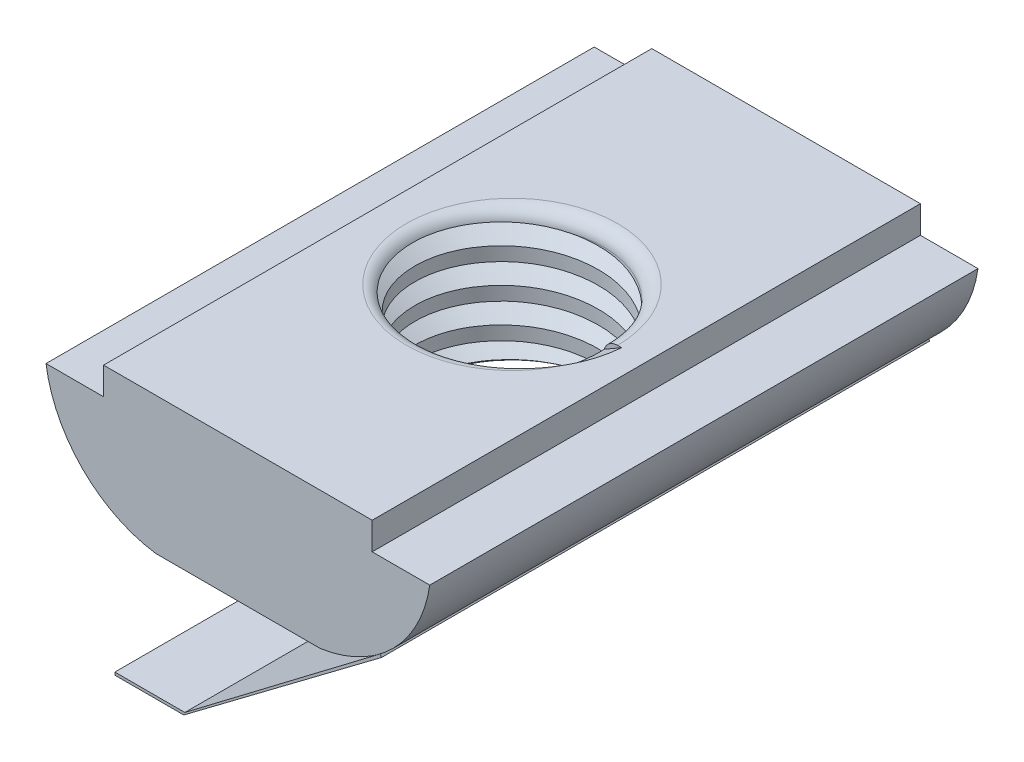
ISO-10303-21;
HEADER;
FILE_DESCRIPTION(('STEP AP214'),'2;1');
FILE_NAME('part.step','',(''),(''),'','','');
FILE_SCHEMA(('AUTOMOTIVE_DESIGN { 1 0 10303 214 1 1 1 1 }'));
ENDSEC;
DATA;
#1=APPLICATION_CONTEXT('core data for automotive mechanical design processes');
#2=APPLICATION_PROTOCOL_DEFINITION('international standard','automotive_design',2000,#1);
#3=PRODUCT_CONTEXT('',#1,'mechanical');
#4=PRODUCT('Part','Part','',(#3));
#5=PRODUCT_RELATED_PRODUCT_CATEGORY('part','',(#4));
#6=PRODUCT_DEFINITION_FORMATION('','',#4);
#7=PRODUCT_DEFINITION_CONTEXT('part definition',#1,'design');
#8=PRODUCT_DEFINITION('design','',#6,#7);
#9=PRODUCT_DEFINITION_SHAPE('','',#8);
#10=(LENGTH_UNIT() NAMED_UNIT(*) SI_UNIT(.MILLI.,.METRE.));
#11=(NAMED_UNIT(*) PLANE_ANGLE_UNIT() SI_UNIT($,.RADIAN.));
#12=(NAMED_UNIT(*) SI_UNIT($,.STERADIAN.) SOLID_ANGLE_UNIT());
#13=UNCERTAINTY_MEASURE_WITH_UNIT(LENGTH_MEASURE(1.E-05),#10,'distance_accuracy_value','');
#14=(GEOMETRIC_REPRESENTATION_CONTEXT(3) GLOBAL_UNCERTAINTY_ASSIGNED_CONTEXT((#13)) GLOBAL_UNIT_ASSIGNED_CONTEXT((#10,
#11,#12)) REPRESENTATION_CONTEXT('',''));
#15=CARTESIAN_POINT('',(0.,0.,0.));
#16=DIRECTION('',(0.,0.,1.));
#17=DIRECTION('',(1.,0.,0.));
#18=AXIS2_PLACEMENT_3D('',#15,#16,#17);
#19=CARTESIAN_POINT('',(-1.9352636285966,-9.49143843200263,-21.1794450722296));
#20=DIRECTION('',(0.,1.,0.));
#21=DIRECTION('',(0.,0.,1.));
#22=AXIS2_PLACEMENT_3D('',#19,#20,#21);
#23=PLANE('',#22);
#24=DIRECTION('',(1.,0.,0.));
#25=VECTOR('',#24,1.);
#26=CARTESIAN_POINT('',(-5.4980649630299,-9.49143843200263,-5.));
#27=LINE('',#26,#25);
#28=CARTESIAN_POINT('',(-4.48798140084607,-9.49143843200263,-5.00000000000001));
#29=VERTEX_POINT('',#28);
#30=CARTESIAN_POINT('',(-1.9352636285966,-9.49143843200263,-5.00000000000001));
#31=VERTEX_POINT('',#30);
#32=EDGE_CURVE('E143',#29,#31,#27,.T.);
#33=ORIENTED_EDGE('',*,*,#32,.T.);
#34=DIRECTION('',(0.,0.,1.));
#35=VECTOR('',#34,1.);
#36=CARTESIAN_POINT('',(-1.9352636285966,-9.49143843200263,-21.1794450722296));
#37=LINE('',#36,#35);
#38=CARTESIAN_POINT('',(-1.9352636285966,-9.49143843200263,-10.));
#39=VERTEX_POINT('',#38);
#40=EDGE_CURVE('E172',#39,#31,#37,.T.);
#41=ORIENTED_EDGE('',*,*,#40,.F.);
#42=DIRECTION('',(-1.,0.,0.));
#43=VECTOR('',#42,1.);
#44=CARTESIAN_POINT('',(-1.9352636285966,-9.49143843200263,-10.));
#45=LINE('',#44,#43);
#46=CARTESIAN_POINT('',(-4.48798140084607,-9.49143843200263,-10.));
#47=VERTEX_POINT('',#46);
#48=EDGE_CURVE('E174',#39,#47,#45,.T.);
#49=ORIENTED_EDGE('',*,*,#48,.T.);
#50=DIRECTION('',(0.,0.,1.));
#51=VECTOR('',#50,1.);
#52=CARTESIAN_POINT('',(-4.48798140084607,-9.49143843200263,-21.1794450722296));
#53=LINE('',#52,#51);
#54=EDGE_CURVE('E170',#47,#29,#53,.T.);
#55=ORIENTED_EDGE('',*,*,#54,.T.);
#56=EDGE_LOOP('',(#33,#41,#49,#55));
#57=FACE_BOUND('',#56,.T.);
#58=ADVANCED_FACE('F43',(#57),#23,.T.);
#59=CARTESIAN_POINT('',(-4.48798140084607,-9.49143843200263,-21.1794450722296));
#60=DIRECTION('',(-1.,0.,0.));
#61=DIRECTION('',(0.,0.,1.));
#62=AXIS2_PLACEMENT_3D('',#59,#60,#61);
#63=PLANE('',#62);
#64=DIRECTION('',(0.,1.,0.));
#65=VECTOR('',#64,1.);
#66=CARTESIAN_POINT('',(-4.48798140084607,1.13081086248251,-5.));
#67=LINE('',#66,#65);
#68=CARTESIAN_POINT('',(-4.48798140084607,-9.59143843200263,-5.00000000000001));
#69=VERTEX_POINT('',#68);
#70=EDGE_CURVE('E140',#69,#29,#67,.T.);
#71=ORIENTED_EDGE('',*,*,#70,.T.);
#72=ORIENTED_EDGE('',*,*,#54,.F.);
#73=DIRECTION('',(0.,-1.,0.));
#74=VECTOR('',#73,1.);
#75=CARTESIAN_POINT('',(-4.48798140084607,-9.49143843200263,-10.));
#76=LINE('',#75,#74);
#77=CARTESIAN_POINT('',(-4.48798140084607,-9.59143843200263,-10.));
#78=VERTEX_POINT('',#77);
#79=EDGE_CURVE('E161',#47,#78,#76,.T.);
#80=ORIENTED_EDGE('',*,*,#79,.T.);
#81=DIRECTION('',(0.,0.,1.));
#82=VECTOR('',#81,1.);
#83=CARTESIAN_POINT('',(-4.48798140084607,-9.59143843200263,-21.1794450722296));
#84=LINE('',#83,#82);
#85=EDGE_CURVE('E154',#78,#69,#84,.T.);
#86=ORIENTED_EDGE('',*,*,#85,.T.);
#87=EDGE_LOOP('',(#71,#72,#80,#86));
#88=FACE_BOUND('',#87,.T.);
#89=ADVANCED_FACE('F160',(#88),#63,.T.);
#90=CARTESIAN_POINT('',(-4.48798140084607,-9.59143843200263,-21.1794450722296));
#91=DIRECTION('',(0.,-1.,0.));
#92=DIRECTION('',(1.,0.,0.));
#93=AXIS2_PLACEMENT_3D('',#90,#91,#92);
#94=PLANE('',#93);
#95=DIRECTION('',(-1.,0.,0.));
#96=VECTOR('',#95,1.);
#97=CARTESIAN_POINT('',(-5.49806496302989,-9.59143843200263,-5.));
#98=LINE('',#97,#96);
#99=CARTESIAN_POINT('',(-1.97407427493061,-9.59143843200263,-5.));
#100=VERTEX_POINT('',#99);
#101=EDGE_CURVE('E110',#100,#69,#98,.T.);
#102=ORIENTED_EDGE('',*,*,#101,.T.);
#103=ORIENTED_EDGE('',*,*,#85,.F.);
#104=DIRECTION('',(1.,0.,0.));
#105=VECTOR('',#104,1.);
#106=CARTESIAN_POINT('',(-4.48798140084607,-9.59143843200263,-10.));
#107=LINE('',#106,#105);
#108=CARTESIAN_POINT('',(-1.97407427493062,-9.59143843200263,-10.));
#109=VERTEX_POINT('',#108);
#110=EDGE_CURVE('E162',#78,#109,#107,.T.);
#111=ORIENTED_EDGE('',*,*,#110,.T.);
#112=DIRECTION('',(0.,0.,1.));
#113=VECTOR('',#112,1.);
#114=CARTESIAN_POINT('',(-1.97407427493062,-9.59143843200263,-21.1794450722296));
#115=LINE('',#114,#113);
#116=EDGE_CURVE('E157',#109,#100,#115,.T.);
#117=ORIENTED_EDGE('',*,*,#116,.T.);
#118=EDGE_LOOP('',(#102,#103,#111,#117));
#119=FACE_BOUND('',#118,.T.);
#120=ADVANCED_FACE('F152',(#119),#94,.T.);
#121=CARTESIAN_POINT('',(2.32608163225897,-0.326081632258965,-10.));
#122=DIRECTION('',(0.,0.,-1.));
#123=DIRECTION('',(-1.,0.,0.));
#124=AXIS2_PLACEMENT_3D('',#121,#122,#123);
#125=PLANE('',#124);
#126=DIRECTION('',(-0.796406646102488,-0.604761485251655,0.));
#127=VECTOR('',#126,1.);
#128=CARTESIAN_POINT('',(5.18191872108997,-4.086915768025,-10.));
#129=LINE('',#128,#127);
#130=CARTESIAN_POINT('',(5.18191872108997,-4.086915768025,-10.));
#131=VERTEX_POINT('',#130);
#132=EDGE_CURVE('E103',#131,#39,#129,.T.);
#133=ORIENTED_EDGE('',*,*,#132,.F.);
#134=DIRECTION('',(0.604761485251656,-0.796406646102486,0.));
#135=VECTOR('',#134,1.);
#136=CARTESIAN_POINT('',(5.18191872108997,-4.086915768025,-10.));
#137=LINE('',#136,#135);
#138=CARTESIAN_POINT('',(5.24239486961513,-4.16655643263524,-10.));
#139=VERTEX_POINT('',#138);
#140=EDGE_CURVE('E192',#131,#139,#137,.T.);
#141=ORIENTED_EDGE('',*,*,#140,.T.);
#142=DIRECTION('',(-0.799333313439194,-0.600887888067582,0.));
#143=VECTOR('',#142,1.);
#144=CARTESIAN_POINT('',(5.24239486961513,-4.16655643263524,-10.));
#145=LINE('',#144,#143);
#146=EDGE_CURVE('E194',#139,#109,#145,.T.);
#147=ORIENTED_EDGE('',*,*,#146,.T.);
#148=ORIENTED_EDGE('',*,*,#110,.F.);
#149=ORIENTED_EDGE('',*,*,#79,.F.);
#150=ORIENTED_EDGE('',*,*,#48,.F.);
#151=EDGE_LOOP('',(#133,#141,#147,#148,#149,#150));
#152=FACE_BOUND('',#151,.T.);
#153=ADVANCED_FACE('F45',(#152),#125,.T.);
#154=CARTESIAN_POINT('',(0.,0.,10.));
#155=DIRECTION('',(0.,0.,-1.));
#156=DIRECTION('',(-1.,0.,0.));
#157=AXIS2_PLACEMENT_3D('',#154,#155,#156);
#158=PLANE('',#157);
#159=DIRECTION('',(0.604761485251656,-0.796406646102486,0.));
#160=VECTOR('',#159,1.);
#161=CARTESIAN_POINT('',(5.18191872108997,-4.086915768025,10.));
#162=LINE('',#161,#160);
#163=CARTESIAN_POINT('',(5.18191872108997,-4.086915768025,10.));
#164=VERTEX_POINT('',#163);
#165=CARTESIAN_POINT('',(5.24239486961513,-4.16655643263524,10.));
#166=VERTEX_POINT('',#165);
#167=EDGE_CURVE('E12',#164,#166,#162,.T.);
#168=ORIENTED_EDGE('',*,*,#167,.F.);
#169=DIRECTION('',(-0.796406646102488,-0.604761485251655,0.));
#170=VECTOR('',#169,1.);
#171=CARTESIAN_POINT('',(5.18191872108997,-4.086915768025,10.));
#172=LINE('',#171,#170);
#173=CARTESIAN_POINT('',(-1.9352636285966,-9.49143843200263,10.));
#174=VERTEX_POINT('',#173);
#175=EDGE_CURVE('E196',#164,#174,#172,.T.);
#176=ORIENTED_EDGE('',*,*,#175,.T.);
#177=DIRECTION('',(-1.,0.,0.));
#178=VECTOR('',#177,1.);
#179=CARTESIAN_POINT('',(-1.9352636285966,-9.49143843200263,10.));
#180=LINE('',#179,#178);
#181=CARTESIAN_POINT('',(-4.48798140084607,-9.49143843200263,10.));
#182=VERTEX_POINT('',#181);
#183=EDGE_CURVE('E219',#174,#182,#180,.T.);
#184=ORIENTED_EDGE('',*,*,#183,.T.);
#185=DIRECTION('',(0.,-1.,0.));
#186=VECTOR('',#185,1.);
#187=CARTESIAN_POINT('',(-4.48798140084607,-9.49143843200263,10.));
#188=LINE('',#187,#186);
#189=CARTESIAN_POINT('',(-4.48798140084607,-9.59143843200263,10.));
#190=VERTEX_POINT('',#189);
#191=EDGE_CURVE('E188',#182,#190,#188,.T.);
#192=ORIENTED_EDGE('',*,*,#191,.T.);
#193=DIRECTION('',(1.,0.,0.));
#194=VECTOR('',#193,1.);
#195=CARTESIAN_POINT('',(-4.48798140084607,-9.59143843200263,10.));
#196=LINE('',#195,#194);
#197=CARTESIAN_POINT('',(-1.97407427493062,-9.59143843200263,10.));
#198=VERTEX_POINT('',#197);
#199=EDGE_CURVE('E185',#190,#198,#196,.T.);
#200=ORIENTED_EDGE('',*,*,#199,.T.);
#201=DIRECTION('',(-0.799333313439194,-0.600887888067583,0.));
#202=VECTOR('',#201,1.);
#203=CARTESIAN_POINT('',(5.24239486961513,-4.16655643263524,10.));
#204=LINE('',#203,#202);
#205=EDGE_CURVE('E199',#166,#198,#204,.T.);
#206=ORIENTED_EDGE('',*,*,#205,.F.);
#207=EDGE_LOOP('',(#168,#176,#184,#192,#200,#206));
#208=FACE_BOUND('',#207,.T.);
#209=ADVANCED_FACE('F215',(#208),#158,.F.);
#210=CARTESIAN_POINT('',(5.18191872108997,-4.086915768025,-21.1794450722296));
#211=DIRECTION('',(-0.604761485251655,0.796406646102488,0.));
#212=DIRECTION('',(-0.796406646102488,-0.604761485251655,0.));
#213=AXIS2_PLACEMENT_3D('',#210,#211,#212);
#214=PLANE('',#213);
#215=DIRECTION('',(0.796406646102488,0.604761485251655,0.));
#216=VECTOR('',#215,1.);
#217=CARTESIAN_POINT('',(0.92103972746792,-7.32246826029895,-5.));
#218=LINE('',#217,#216);
#219=CARTESIAN_POINT('',(0.879999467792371,-7.35363270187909,-5.));
#220=VERTEX_POINT('',#219);
#221=EDGE_CURVE('E242',#31,#220,#218,.T.);
#222=ORIENTED_EDGE('',*,*,#221,.T.);
#223=CARTESIAN_POINT('',(0.879999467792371,-7.35363270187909,0.));
#224=DIRECTION('',(-0.604761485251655,0.796406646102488,0.));
#225=DIRECTION('',(-0.796406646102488,-0.604761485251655,0.));
#226=AXIS2_PLACEMENT_3D('',#223,#224,#225);
#227=ELLIPSE('',#226,5.00005892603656,5.);
#228=CARTESIAN_POINT('',(0.879999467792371,-7.35363270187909,5.));
#229=VERTEX_POINT('',#228);
#230=EDGE_CURVE('E244',#220,#229,#227,.F.);
#231=ORIENTED_EDGE('',*,*,#230,.T.);
#232=DIRECTION('',(-0.796406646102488,-0.604761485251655,0.));
#233=VECTOR('',#232,1.);
#234=CARTESIAN_POINT('',(0.92103972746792,-7.32246826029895,5.));
#235=LINE('',#234,#233);
#236=CARTESIAN_POINT('',(-1.9352636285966,-9.49143843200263,4.99999999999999));
#237=VERTEX_POINT('',#236);
#238=EDGE_CURVE('E195',#229,#237,#235,.T.);
#239=ORIENTED_EDGE('',*,*,#238,.T.);
#240=EDGE_CURVE('E175',#237,#174,#37,.T.);
#241=ORIENTED_EDGE('',*,*,#240,.T.);
#242=ORIENTED_EDGE('',*,*,#175,.F.);
#243=DIRECTION('',(0.,0.,1.));
#244=VECTOR('',#243,1.);
#245=CARTESIAN_POINT('',(5.18191872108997,-4.086915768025,-21.1794450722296));
#246=LINE('',#245,#244);
#247=EDGE_CURVE('E47',#131,#164,#246,.T.);
#248=ORIENTED_EDGE('',*,*,#247,.F.);
#249=ORIENTED_EDGE('',*,*,#132,.T.);
#250=ORIENTED_EDGE('',*,*,#40,.T.);
#251=EDGE_LOOP('',(#222,#231,#239,#241,#242,#248,#249,#250));
#252=FACE_BOUND('',#251,.T.);
#253=ADVANCED_FACE('F250',(#252),#214,.T.);
#254=DIRECTION('',(-1.,0.,0.));
#255=VECTOR('',#254,1.);
#256=CARTESIAN_POINT('',(-5.4980649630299,-9.49143843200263,5.));
#257=LINE('',#256,#255);
#258=CARTESIAN_POINT('',(-4.48798140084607,-9.49143843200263,4.99999999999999));
#259=VERTEX_POINT('',#258);
#260=EDGE_CURVE('E227',#237,#259,#257,.T.);
#261=ORIENTED_EDGE('',*,*,#260,.T.);
#262=EDGE_CURVE('E171',#259,#182,#53,.T.);
#263=ORIENTED_EDGE('',*,*,#262,.T.);
#264=ORIENTED_EDGE('',*,*,#183,.F.);
#265=ORIENTED_EDGE('',*,*,#240,.F.);
#266=EDGE_LOOP('',(#261,#263,#264,#265));
#267=FACE_BOUND('',#266,.T.);
#268=ADVANCED_FACE('F255',(#267),#23,.T.);
#269=DIRECTION('',(0.,-1.,0.));
#270=VECTOR('',#269,1.);
#271=CARTESIAN_POINT('',(-4.48798140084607,1.13081086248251,5.));
#272=LINE('',#271,#270);
#273=CARTESIAN_POINT('',(-4.48798140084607,-9.59143843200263,4.99999999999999));
#274=VERTEX_POINT('',#273);
#275=EDGE_CURVE('E230',#259,#274,#272,.T.);
#276=ORIENTED_EDGE('',*,*,#275,.T.);
#277=EDGE_CURVE('E163',#274,#190,#84,.T.);
#278=ORIENTED_EDGE('',*,*,#277,.T.);
#279=ORIENTED_EDGE('',*,*,#191,.F.);
#280=ORIENTED_EDGE('',*,*,#262,.F.);
#281=EDGE_LOOP('',(#276,#278,#279,#280));
#282=FACE_BOUND('',#281,.T.);
#283=ADVANCED_FACE('F256',(#282),#63,.T.);
#284=DIRECTION('',(1.,0.,0.));
#285=VECTOR('',#284,1.);
#286=CARTESIAN_POINT('',(-5.49806496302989,-9.59143843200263,5.));
#287=LINE('',#286,#285);
#288=CARTESIAN_POINT('',(-1.97407427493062,-9.59143843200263,4.99999999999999));
#289=VERTEX_POINT('',#288);
#290=EDGE_CURVE('E158',#274,#289,#287,.T.);
#291=ORIENTED_EDGE('',*,*,#290,.T.);
#292=EDGE_CURVE('E165',#289,#198,#115,.T.);
#293=ORIENTED_EDGE('',*,*,#292,.T.);
#294=ORIENTED_EDGE('',*,*,#199,.F.);
#295=ORIENTED_EDGE('',*,*,#277,.F.);
#296=EDGE_LOOP('',(#291,#293,#294,#295));
#297=FACE_BOUND('',#296,.T.);
#298=ADVANCED_FACE('F209',(#297),#94,.T.);
#299=CARTESIAN_POINT('',(5.24239486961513,-4.16655643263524,-21.1794450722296));
#300=DIRECTION('',(-0.600887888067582,0.799333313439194,0.));
#301=DIRECTION('',(-0.799333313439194,-0.600887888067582,0.));
#302=AXIS2_PLACEMENT_3D('',#299,#300,#301);
#303=PLANE('',#302);
#304=CARTESIAN_POINT('',(0.924329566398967,-7.41260297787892,0.));
#305=DIRECTION('',(0.600887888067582,-0.799333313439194,0.));
#306=DIRECTION('',(0.799333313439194,0.600887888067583,0.));
#307=AXIS2_PLACEMENT_3D('',#304,#305,#306);
#308=CIRCLE('',#307,5.);
#309=CARTESIAN_POINT('',(0.924329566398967,-7.41260297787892,-5.));
#310=VERTEX_POINT('',#309);
#311=CARTESIAN_POINT('',(0.924329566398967,-7.41260297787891,5.));
#312=VERTEX_POINT('',#311);
#313=EDGE_CURVE('E59',#310,#312,#308,.T.);
#314=ORIENTED_EDGE('',*,*,#313,.F.);
#315=DIRECTION('',(0.799333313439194,0.600887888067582,0.));
#316=VECTOR('',#315,1.);
#317=CARTESIAN_POINT('',(0.924329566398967,-7.41260297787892,-5.));
#318=LINE('',#317,#316);
#319=EDGE_CURVE('E236',#100,#310,#318,.T.);
#320=ORIENTED_EDGE('',*,*,#319,.F.);
#321=ORIENTED_EDGE('',*,*,#116,.F.);
#322=ORIENTED_EDGE('',*,*,#146,.F.);
#323=DIRECTION('',(0.,0.,1.));
#324=VECTOR('',#323,1.);
#325=CARTESIAN_POINT('',(5.24239486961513,-4.16655643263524,-21.1794450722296));
#326=LINE('',#325,#324);
#327=EDGE_CURVE('E198',#139,#166,#326,.T.);
#328=ORIENTED_EDGE('',*,*,#327,.T.);
#329=ORIENTED_EDGE('',*,*,#205,.T.);
#330=ORIENTED_EDGE('',*,*,#292,.F.);
#331=DIRECTION('',(-0.799333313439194,-0.600887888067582,0.));
#332=VECTOR('',#331,1.);
#333=CARTESIAN_POINT('',(0.924329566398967,-7.41260297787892,5.));
#334=LINE('',#333,#332);
#335=EDGE_CURVE('E239',#312,#289,#334,.T.);
#336=ORIENTED_EDGE('',*,*,#335,.F.);
#337=EDGE_LOOP('',(#314,#320,#321,#322,#328,#329,#330,#336));
#338=FACE_BOUND('',#337,.T.);
#339=ADVANCED_FACE('F213',(#338),#303,.F.);
#340=CARTESIAN_POINT('',(5.18191872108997,-4.086915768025,-21.1794450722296));
#341=DIRECTION('',(-0.796406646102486,-0.604761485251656,0.));
#342=DIRECTION('',(0.604761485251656,-0.796406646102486,0.));
#343=AXIS2_PLACEMENT_3D('',#340,#341,#342);
#344=PLANE('',#343);
#345=ORIENTED_EDGE('',*,*,#140,.F.);
#346=ORIENTED_EDGE('',*,*,#247,.T.);
#347=ORIENTED_EDGE('',*,*,#167,.T.);
#348=ORIENTED_EDGE('',*,*,#327,.F.);
#349=EDGE_LOOP('',(#345,#346,#347,#348));
#350=FACE_BOUND('',#349,.T.);
#351=ADVANCED_FACE('F280',(#350),#344,.F.);
#352=CARTESIAN_POINT('',(-5.4980649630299,1.13081086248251,0.));
#353=DIRECTION('',(0.600887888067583,-0.799333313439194,0.));
#354=DIRECTION('',(0.799333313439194,0.600887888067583,0.));
#355=AXIS2_PLACEMENT_3D('',#352,#353,#354);
#356=CYLINDRICAL_SURFACE('',#355,5.);
#357=DIRECTION('',(0.600887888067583,-0.799333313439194,0.));
#358=VECTOR('',#357,1.);
#359=CARTESIAN_POINT('',(-5.4980649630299,1.13081086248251,-5.));
#360=LINE('',#359,#358);
#361=EDGE_CURVE('E233',#220,#310,#360,.T.);
#362=ORIENTED_EDGE('',*,*,#361,.T.);
#363=ORIENTED_EDGE('',*,*,#313,.T.);
#364=DIRECTION('',(0.600887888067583,-0.799333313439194,0.));
#365=VECTOR('',#364,1.);
#366=CARTESIAN_POINT('',(-5.4980649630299,1.13081086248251,5.));
#367=LINE('',#366,#365);
#368=EDGE_CURVE('E234',#229,#312,#367,.T.);
#369=ORIENTED_EDGE('',*,*,#368,.F.);
#370=ORIENTED_EDGE('',*,*,#230,.F.);
#371=EDGE_LOOP('',(#362,#363,#369,#370));
#372=FACE_BOUND('',#371,.T.);
#373=ADVANCED_FACE('F251',(#372),#356,.F.);
#374=CARTESIAN_POINT('',(-5.4980649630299,1.13081086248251,-5.));
#375=DIRECTION('',(0.,0.,-1.));
#376=DIRECTION('',(-1.,0.,0.));
#377=AXIS2_PLACEMENT_3D('',#374,#375,#376);
#378=PLANE('',#377);
#379=ORIENTED_EDGE('',*,*,#32,.F.);
#380=ORIENTED_EDGE('',*,*,#70,.F.);
#381=ORIENTED_EDGE('',*,*,#101,.F.);
#382=ORIENTED_EDGE('',*,*,#319,.T.);
#383=ORIENTED_EDGE('',*,*,#361,.F.);
#384=ORIENTED_EDGE('',*,*,#221,.F.);
#385=EDGE_LOOP('',(#379,#380,#381,#382,#383,#384));
#386=FACE_BOUND('',#385,.T.);
#387=ADVANCED_FACE('F141',(#386),#378,.F.);
#388=CARTESIAN_POINT('',(-5.4980649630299,1.13081086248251,5.));
#389=DIRECTION('',(0.,0.,1.));
#390=DIRECTION('',(1.,0.,0.));
#391=AXIS2_PLACEMENT_3D('',#388,#389,#390);
#392=PLANE('',#391);
#393=ORIENTED_EDGE('',*,*,#368,.T.);
#394=ORIENTED_EDGE('',*,*,#335,.T.);
#395=ORIENTED_EDGE('',*,*,#290,.F.);
#396=ORIENTED_EDGE('',*,*,#275,.F.);
#397=ORIENTED_EDGE('',*,*,#260,.F.);
#398=ORIENTED_EDGE('',*,*,#238,.F.);
#399=EDGE_LOOP('',(#393,#394,#395,#396,#397,#398));
#400=FACE_BOUND('',#399,.T.);
#401=ADVANCED_FACE('F253',(#400),#392,.F.);
#402=CLOSED_SHELL('',(#58,#89,#120,#153,#209,#253,#268,#283,#298,#339,#351,#373,#387,#401));
#403=MANIFOLD_SOLID_BREP('B2',#402);
#404=CARTESIAN_POINT('',(4.9,0.,10.));
#405=DIRECTION('',(0.,-1.,0.));
#406=DIRECTION('',(1.,0.,0.));
#407=AXIS2_PLACEMENT_3D('',#404,#405,#406);
#408=PLANE('',#407);
#409=DIRECTION('',(-1.,0.,0.));
#410=VECTOR('',#409,1.);
#411=CARTESIAN_POINT('',(4.9,0.,-10.));
#412=LINE('',#411,#410);
#413=CARTESIAN_POINT('',(4.9,0.,-10.));
#414=VERTEX_POINT('',#413);
#415=CARTESIAN_POINT('',(-4.9,0.,-10.));
#416=VERTEX_POINT('',#415);
#417=EDGE_CURVE('E530',#414,#416,#412,.T.);
#418=ORIENTED_EDGE('',*,*,#417,.T.);
#419=DIRECTION('',(0.,0.,-1.));
#420=VECTOR('',#419,1.);
#421=CARTESIAN_POINT('',(-4.9,0.,10.));
#422=LINE('',#421,#420);
#423=CARTESIAN_POINT('',(-4.9,0.,10.));
#424=VERTEX_POINT('',#423);
#425=EDGE_CURVE('E569',#424,#416,#422,.T.);
#426=ORIENTED_EDGE('',*,*,#425,.F.);
#427=DIRECTION('',(-1.,0.,0.));
#428=VECTOR('',#427,1.);
#429=CARTESIAN_POINT('',(4.9,0.,10.));
#430=LINE('',#429,#428);
#431=CARTESIAN_POINT('',(4.9,0.,10.));
#432=VERTEX_POINT('',#431);
#433=EDGE_CURVE('E544',#432,#424,#430,.T.);
#434=ORIENTED_EDGE('',*,*,#433,.F.);
#435=DIRECTION('',(0.,0.,-1.));
#436=VECTOR('',#435,1.);
#437=CARTESIAN_POINT('',(4.9,0.,10.));
#438=LINE('',#437,#436);
#439=EDGE_CURVE('E566',#432,#414,#438,.T.);
#440=ORIENTED_EDGE('',*,*,#439,.T.);
#441=EDGE_LOOP('',(#418,#426,#434,#440));
#442=FACE_BOUND('',#441,.T.);
#443=DIRECTION('',(-1.,0.,0.));
#444=VECTOR('',#443,1.);
#445=CARTESIAN_POINT('',(4.9,0.,0.));
#446=LINE('',#445,#444);
#447=CARTESIAN_POINT('',(4.,0.,0.));
#448=VERTEX_POINT('',#447);
#449=CARTESIAN_POINT('',(3.85,0.,0.));
#450=VERTEX_POINT('',#449);
#451=EDGE_CURVE('E489',#448,#450,#446,.T.);
#452=ORIENTED_EDGE('',*,*,#451,.F.);
#453=CARTESIAN_POINT('',(4.,0.,0.));
#454=CARTESIAN_POINT('',(3.99118333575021,0.,0.108099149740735));
#455=CARTESIAN_POINT('',(3.97778541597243,0.,0.21582303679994));
#456=CARTESIAN_POINT('',(3.94196860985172,0.,0.429753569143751));
#457=CARTESIAN_POINT('',(3.91955030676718,0.,0.535960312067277));
#458=CARTESIAN_POINT('',(3.86586294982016,0.,0.745987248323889));
#459=CARTESIAN_POINT('',(3.8346037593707,0.,0.849809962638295));
#460=CARTESIAN_POINT('',(3.76344591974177,0.,1.05445197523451));
#461=CARTESIAN_POINT('',(3.72354722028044,0.,1.15527125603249));
#462=CARTESIAN_POINT('',(3.6353953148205,0.,1.35317483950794));
#463=CARTESIAN_POINT('',(3.58714308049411,0.,1.45025957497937));
#464=CARTESIAN_POINT('',(3.48262365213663,0.,1.64001409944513));
#465=CARTESIAN_POINT('',(3.42635646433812,0.,1.73268389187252));
#466=CARTESIAN_POINT('',(3.30618624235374,0.,1.91297566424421));
#467=CARTESIAN_POINT('',(3.24228080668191,0.,2.00059604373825));
#468=CARTESIAN_POINT('',(3.10730526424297,0.,2.1701460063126));
#469=CARTESIAN_POINT('',(3.03623431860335,0.,2.25207492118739));
#470=CARTESIAN_POINT('',(2.88737266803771,0.,2.40967908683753));
#471=CARTESIAN_POINT('',(2.80957849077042,0.,2.48535106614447));
#472=CARTESIAN_POINT('',(2.68837312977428,0.,2.5937642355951));
#473=CARTESIAN_POINT('',(2.64721660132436,0.,2.62905462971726));
#474=CARTESIAN_POINT('',(2.56336182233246,0.,2.69775425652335));
#475=CARTESIAN_POINT('',(2.5206636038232,0.,2.73116352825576));
#476=CARTESIAN_POINT('',(2.39042576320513,0.,2.82837667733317));
#477=CARTESIAN_POINT('',(2.30066202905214,0.,2.88923859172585));
#478=CARTESIAN_POINT('',(2.11600024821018,0.,3.00257758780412));
#479=CARTESIAN_POINT('',(2.02110198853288,0.,3.0550543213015));
#480=CARTESIAN_POINT('',(1.8314249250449,0.,3.14896715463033));
#481=CARTESIAN_POINT('',(1.73684314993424,0.,3.19080131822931));
#482=CARTESIAN_POINT('',(1.54441581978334,0.,3.26612913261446));
#483=CARTESIAN_POINT('',(1.44657031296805,0.,3.29962290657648));
#484=CARTESIAN_POINT('',(1.24826254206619,0.,3.35804169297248));
#485=CARTESIAN_POINT('',(1.14779810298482,0.,3.38295932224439));
#486=CARTESIAN_POINT('',(0.945088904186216,0.,3.42399641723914));
#487=CARTESIAN_POINT('',(0.842844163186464,0.,3.44011597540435));
#488=CARTESIAN_POINT('',(0.640045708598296,0.,3.46313422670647));
#489=CARTESIAN_POINT('',(0.539518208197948,0.,3.47026420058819));
#490=CARTESIAN_POINT('',(0.33821877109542,0.,3.47601144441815));
#491=CARTESIAN_POINT('',(0.237446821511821,0.,3.47462825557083));
#492=CARTESIAN_POINT('',(0.0364620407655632,0.,3.46342018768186));
#493=CARTESIAN_POINT('',(-0.0637512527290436,0.,3.45360384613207));
#494=CARTESIAN_POINT('',(-0.262850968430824,0.,3.42482204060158));
#495=CARTESIAN_POINT('',(-0.361737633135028,0.,3.40585827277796));
#496=CARTESIAN_POINT('',(-0.554687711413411,0.,3.35967576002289));
#497=CARTESIAN_POINT('',(-0.648809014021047,0.,3.332697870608));
#498=CARTESIAN_POINT('',(-0.834305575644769,0.,3.27050093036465));
#499=CARTESIAN_POINT('',(-0.925680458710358,0.,3.23528075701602));
#500=CARTESIAN_POINT('',(-1.10500439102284,0.,3.1568559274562));
#501=CARTESIAN_POINT('',(-1.19295124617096,0.,3.11364625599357));
#502=CARTESIAN_POINT('',(-1.36466295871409,0.,3.0195930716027));
#503=CARTESIAN_POINT('',(-1.44842792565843,0.,2.96874975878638));
#504=CARTESIAN_POINT('',(-1.60705571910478,0.,2.86254624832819));
#505=CARTESIAN_POINT('',(-1.68215415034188,0.,2.80753740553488));
#506=CARTESIAN_POINT('',(-1.82745886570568,0.,2.69137762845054));
#507=CARTESIAN_POINT('',(-1.89766457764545,0.,2.63022597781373));
#508=CARTESIAN_POINT('',(-2.03260557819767,0.,2.50225581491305));
#509=CARTESIAN_POINT('',(-2.09734460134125,0.,2.43544123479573));
#510=CARTESIAN_POINT('',(-2.22102220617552,0.,2.29664628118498));
#511=CARTESIAN_POINT('',(-2.27996175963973,0.,2.22466677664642));
#512=CARTESIAN_POINT('',(-2.39060292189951,0.,2.07607930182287));
#513=CARTESIAN_POINT('',(-2.44235048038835,0.,1.99950566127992));
#514=CARTESIAN_POINT('',(-2.53867700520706,0.,1.84197125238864));
#515=CARTESIAN_POINT('',(-2.58325538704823,0.,1.76101012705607));
#516=CARTESIAN_POINT('',(-2.66485327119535,0.,1.59535688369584));
#517=CARTESIAN_POINT('',(-2.70187231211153,0.,1.5106645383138));
#518=CARTESIAN_POINT('',(-2.76804867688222,0.,1.33822631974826));
#519=CARTESIAN_POINT('',(-2.79720326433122,0.,1.25047939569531));
#520=CARTESIAN_POINT('',(-2.84551975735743,0.,1.07930364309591));
#521=CARTESIAN_POINT('',(-2.86526313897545,0.,0.996038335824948));
#522=CARTESIAN_POINT('',(-2.89764414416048,0.,0.828138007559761));
#523=CARTESIAN_POINT('',(-2.91028202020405,0.,0.743503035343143));
#524=CARTESIAN_POINT('',(-2.92834431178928,0.,0.573644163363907));
#525=CARTESIAN_POINT('',(-2.93378341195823,0.,0.488421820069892));
#526=CARTESIAN_POINT('',(-2.93745671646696,0.,0.31784859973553));
#527=CARTESIAN_POINT('',(-2.93569374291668,0.,0.232497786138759));
#528=CARTESIAN_POINT('',(-2.92725150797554,0.,0.098156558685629));
#529=CARTESIAN_POINT('',(-2.92295833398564,0.,0.0490075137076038));
#530=CARTESIAN_POINT('',(-2.91746824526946,0.,0.));
#531=B_SPLINE_CURVE_WITH_KNOTS('',3,(#453,#454,#455,#456,#457,#458,#459,#460,#461,#462,#463,
#464,#465,#466,#467,#468,#469,#470,#471,#472,#473,#474,#475,#476,#477,#478,#479,#480,#481,#482,
#483,#484,#485,#486,#487,#488,#489,#490,#491,#492,#493,#494,#495,#496,#497,#498,#499,#500,#501,
#502,#503,#504,#505,#506,#507,#508,#509,#510,#511,#512,#513,#514,#515,#516,#517,#518,#519,#520,
#521,#522,#523,#524,#525,#526,#527,#528,#529,#530),.UNSPECIFIED.,.F.,.F.,(4,2,2,2,2,2,2,2,2,2,2,
2,2,2,2,2,2,2,2,2,2,2,2,2,2,2,2,2,2,2,2,2,2,2,2,2,2,2,4),(0.,0.325275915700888,
0.650530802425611,0.975424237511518,1.30031956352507,1.62517712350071,1.95003443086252,
2.2749941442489,2.59999194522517,2.92515861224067,3.08775986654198,3.25035774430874,
3.57522835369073,3.90011244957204,4.20998716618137,4.51985730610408,4.82999354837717,
5.14012653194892,5.44210591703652,5.74410157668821,6.0457918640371,6.34742623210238,
6.64078180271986,6.93417734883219,7.22775769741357,7.52133035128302,7.80027326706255,
8.07924874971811,8.35803208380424,8.63676862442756,8.91363325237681,9.19052044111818,
9.46742452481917,9.74442483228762,10.0008456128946,10.257257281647,10.5131450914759,
10.7689326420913,10.9168794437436),.UNSPECIFIED.);
#532=CARTESIAN_POINT('',(3.49268661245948,0.,1.61976548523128));
#533=VERTEX_POINT('',#532);
#534=EDGE_CURVE('E498',#448,#533,#531,.T.);
#535=ORIENTED_EDGE('',*,*,#534,.T.);
#536=CARTESIAN_POINT('',(0.,0.,0.));
#537=DIRECTION('',(0.,-1.,0.));
#538=DIRECTION('',(1.,0.,0.));
#539=AXIS2_PLACEMENT_3D('',#536,#537,#538);
#540=CIRCLE('',#539,3.85);
#541=EDGE_CURVE('E512',#533,#450,#540,.T.);
#542=ORIENTED_EDGE('',*,*,#541,.T.);
#543=EDGE_LOOP('',(#452,#535,#542));
#544=FACE_BOUND('',#543,.T.);
#545=ADVANCED_FACE('F368',(#442,#544),#408,.F.);
#546=CARTESIAN_POINT('',(0.,-9.59243843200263,0.));
#547=DIRECTION('',(0.,1.,0.));
#548=DIRECTION('',(-1.,0.,0.));
#549=AXIS2_PLACEMENT_3D('',#546,#547,#548);
#550=CYLINDRICAL_SURFACE('',#549,3.35);
#551=CARTESIAN_POINT('',(3.35,-0.375277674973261,0.));
#552=CARTESIAN_POINT('',(3.35,-0.453402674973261,1.38761543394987));
#553=CARTESIAN_POINT('',(2.36880771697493,-0.531527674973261,2.36880771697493));
#554=CARTESIAN_POINT('',(1.38761543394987,-0.609652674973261,3.35));
#555=CARTESIAN_POINT('',(0.,-0.687777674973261,3.35));
#556=CARTESIAN_POINT('',(-1.38761543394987,-0.765902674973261,3.35));
#557=CARTESIAN_POINT('',(-2.36880771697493,-0.844027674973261,2.36880771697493));
#558=CARTESIAN_POINT('',(-3.35,-0.922152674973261,1.38761543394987));
#559=CARTESIAN_POINT('',(-3.35,-1.00027767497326,0.));
#560=CARTESIAN_POINT('',(-3.35,-1.07840267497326,-1.38761543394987));
#561=CARTESIAN_POINT('',(-2.36880771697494,-1.15652767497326,-2.36880771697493));
#562=CARTESIAN_POINT('',(-1.38761543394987,-1.23465267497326,-3.35));
#563=CARTESIAN_POINT('',(0.,-1.31277767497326,-3.35));
#564=CARTESIAN_POINT('',(1.38761543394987,-1.39090267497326,-3.35));
#565=CARTESIAN_POINT('',(2.36880771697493,-1.46902767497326,-2.36880771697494));
#566=CARTESIAN_POINT('',(3.35,-1.54715267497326,-1.38761543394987));
#567=CARTESIAN_POINT('',(3.35,-1.62527767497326,0.));
#568=CARTESIAN_POINT('',(3.35,-1.70340267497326,1.38761543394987));
#569=CARTESIAN_POINT('',(2.36880771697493,-1.78152767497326,2.36880771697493));
#570=CARTESIAN_POINT('',(1.38761543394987,-1.85965267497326,3.35));
#571=CARTESIAN_POINT('',(0.,-1.93777767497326,3.35));
#572=CARTESIAN_POINT('',(-1.38761543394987,-2.01590267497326,3.35));
#573=CARTESIAN_POINT('',(-2.36880771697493,-2.09402767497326,2.36880771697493));
#574=CARTESIAN_POINT('',(-3.35,-2.17215267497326,1.38761543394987));
#575=CARTESIAN_POINT('',(-3.35,-2.25027767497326,0.));
#576=CARTESIAN_POINT('',(-3.35,-2.32840267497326,-1.38761543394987));
#577=CARTESIAN_POINT('',(-2.36880771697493,-2.40652767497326,-2.36880771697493));
#578=CARTESIAN_POINT('',(-1.38761543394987,-2.48465267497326,-3.35));
#579=CARTESIAN_POINT('',(0.,-2.56277767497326,-3.35));
#580=CARTESIAN_POINT('',(1.38761543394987,-2.64090267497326,-3.35));
#581=CARTESIAN_POINT('',(2.36880771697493,-2.71902767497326,-2.36880771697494));
#582=CARTESIAN_POINT('',(3.35,-2.79715267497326,-1.38761543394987));
#583=CARTESIAN_POINT('',(3.35,-2.87527767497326,0.));
#584=CARTESIAN_POINT('',(3.35,-2.95340267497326,1.38761543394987));
#585=CARTESIAN_POINT('',(2.36880771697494,-3.03152767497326,2.36880771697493));
#586=CARTESIAN_POINT('',(1.38761543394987,-3.10965267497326,3.35));
#587=CARTESIAN_POINT('',(0.,-3.18777767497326,3.35));
#588=CARTESIAN_POINT('',(-1.38761543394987,-3.26590267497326,3.35));
#589=CARTESIAN_POINT('',(-2.36880771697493,-3.34402767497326,2.36880771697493));
#590=CARTESIAN_POINT('',(-3.35,-3.42215267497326,1.38761543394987));
#591=CARTESIAN_POINT('',(-3.35,-3.50027767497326,0.));
#592=CARTESIAN_POINT('',(-3.35,-3.57840267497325,-1.38761543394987));
#593=CARTESIAN_POINT('',(-2.36880771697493,-3.65652767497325,-2.36880771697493));
#594=CARTESIAN_POINT('',(-1.38761543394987,-3.73465267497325,-3.35));
#595=CARTESIAN_POINT('',(0.,-3.81277767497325,-3.35));
#596=CARTESIAN_POINT('',(1.38761543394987,-3.89090267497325,-3.35));
#597=CARTESIAN_POINT('',(2.36880771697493,-3.96902767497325,-2.36880771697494));
#598=CARTESIAN_POINT('',(3.35,-4.04715267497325,-1.38761543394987));
#599=CARTESIAN_POINT('',(3.35,-4.12527767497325,0.));
#600=CARTESIAN_POINT('',(3.35,-4.20340267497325,1.38761543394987));
#601=CARTESIAN_POINT('',(2.36880771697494,-4.28152767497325,2.36880771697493));
#602=CARTESIAN_POINT('',(1.38761543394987,-4.35965267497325,3.35));
#603=CARTESIAN_POINT('',(0.,-4.43777767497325,3.35));
#604=CARTESIAN_POINT('',(-1.38761543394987,-4.51590267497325,3.35));
#605=CARTESIAN_POINT('',(-2.36880771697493,-4.59402767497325,2.36880771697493));
#606=CARTESIAN_POINT('',(-3.35,-4.67215267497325,1.38761543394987));
#607=CARTESIAN_POINT('',(-3.35,-4.75027767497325,0.));
#608=CARTESIAN_POINT('',(-3.35,-4.82840267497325,-1.38761543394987));
#609=CARTESIAN_POINT('',(-2.36880771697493,-4.90652767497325,-2.36880771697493));
#610=CARTESIAN_POINT('',(-1.38761543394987,-4.98465267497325,-3.35));
#611=CARTESIAN_POINT('',(0.,-5.06277767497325,-3.35));
#612=CARTESIAN_POINT('',(1.38761543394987,-5.14090267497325,-3.35));
#613=CARTESIAN_POINT('',(2.36880771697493,-5.21902767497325,-2.36880771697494));
#614=CARTESIAN_POINT('',(3.35,-5.29715267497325,-1.38761543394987));
#615=CARTESIAN_POINT('',(3.35,-5.37527767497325,0.));
#616=(BOUNDED_CURVE() B_SPLINE_CURVE(2,(#551,#552,#553,#554,#555,#556,#557,#558,#559,#560,#561,
#562,#563,#564,#565,#566,#567,#568,#569,#570,#571,#572,#573,#574,#575,#576,#577,#578,#579,#580,
#581,#582,#583,#584,#585,#586,#587,#588,#589,#590,#591,#592,#593,#594,#595,#596,#597,#598,#599,
#600,#601,#602,#603,#604,#605,#606,#607,#608,#609,#610,#611,#612,#613,#614,#615),.UNSPECIFIED.,
.F.,.F.) B_SPLINE_CURVE_WITH_KNOTS((3,2,2,2,2,2,2,2,2,2,2,2,2,2,2,2,2,2,2,2,2,2,2,2,2,2,2,2,2,2,
2,2,3),(0.,0.03125,0.0625,0.09375,0.125,0.15625,0.1875,0.21875,0.25,0.28125,0.3125,0.34375,
0.375,0.40625,0.4375,0.46875,0.5,0.53125,0.5625,0.59375,0.625,0.65625,0.6875,0.71875,0.75,
0.78125,0.8125,0.84375,0.875,0.90625,0.9375,0.96875,1.),
.UNSPECIFIED.) CURVE() GEOMETRIC_REPRESENTATION_ITEM() RATIONAL_B_SPLINE_CURVE((1.,
0.923879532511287,1.,0.923879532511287,1.,0.923879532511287,1.,0.923879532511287,1.,
0.923879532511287,1.,0.923879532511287,1.,0.923879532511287,1.,0.923879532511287,1.,
0.923879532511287,1.,0.923879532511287,1.,0.923879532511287,1.,0.923879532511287,1.,
0.923879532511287,1.,0.923879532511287,1.,0.923879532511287,1.,0.923879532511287,1.,
0.923879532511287,1.,0.923879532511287,1.,0.923879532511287,1.,0.923879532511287,1.,
0.923879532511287,1.,0.923879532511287,1.,0.923879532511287,1.,0.923879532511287,1.,
0.923879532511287,1.,0.923879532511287,1.,0.923879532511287,1.,0.923879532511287,1.,
0.923879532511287,1.,0.923879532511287,1.,0.923879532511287,1.,0.923879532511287,1.)) REPRESENTATION_ITEM(''));
#617=CARTESIAN_POINT('',(2.72068251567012,-0.5,1.9545809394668));
#618=VERTEX_POINT('',#617);
#619=CARTESIAN_POINT('',(-1.03700365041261,-4.5,3.18545497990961));
#620=VERTEX_POINT('',#619);
#621=EDGE_CURVE('E638',#618,#620,#616,.T.);
#622=ORIENTED_EDGE('',*,*,#621,.F.);
#623=CARTESIAN_POINT('',(0.,-0.5,0.));
#624=DIRECTION('',(0.,-1.,0.));
#625=DIRECTION('',(1.,0.,0.));
#626=AXIS2_PLACEMENT_3D('',#623,#624,#625);
#627=CIRCLE('',#626,3.35);
#628=CARTESIAN_POINT('',(-1.03700365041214,-0.500000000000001,-3.18545497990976));
#629=VERTEX_POINT('',#628);
#630=EDGE_CURVE('E568',#618,#629,#627,.F.);
#631=ORIENTED_EDGE('',*,*,#630,.T.);
#632=CARTESIAN_POINT('',(3.35,0.375277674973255,0.));
#633=CARTESIAN_POINT('',(3.35,0.297152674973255,1.38761543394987));
#634=CARTESIAN_POINT('',(2.36880771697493,0.219027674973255,2.36880771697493));
#635=CARTESIAN_POINT('',(1.38761543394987,0.140902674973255,3.35));
#636=CARTESIAN_POINT('',(0.,0.0627776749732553,3.35));
#637=CARTESIAN_POINT('',(-1.38761543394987,-0.0153473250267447,3.35));
#638=CARTESIAN_POINT('',(-2.36880771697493,-0.0934723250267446,2.36880771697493));
#639=CARTESIAN_POINT('',(-3.35,-0.171597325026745,1.38761543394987));
#640=CARTESIAN_POINT('',(-3.35,-0.249722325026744,0.));
#641=CARTESIAN_POINT('',(-3.35,-0.327847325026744,-1.38761543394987));
#642=CARTESIAN_POINT('',(-2.36880771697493,-0.405972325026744,-2.36880771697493));
#643=CARTESIAN_POINT('',(-1.38761543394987,-0.484097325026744,-3.35));
#644=CARTESIAN_POINT('',(0.,-0.562222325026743,-3.35));
#645=CARTESIAN_POINT('',(1.38761543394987,-0.640347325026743,-3.35));
#646=CARTESIAN_POINT('',(2.36880771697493,-0.718472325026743,-2.36880771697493));
#647=CARTESIAN_POINT('',(3.35,-0.796597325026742,-1.38761543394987));
#648=CARTESIAN_POINT('',(3.35,-0.874722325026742,0.));
#649=CARTESIAN_POINT('',(3.35,-0.952847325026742,1.38761543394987));
#650=CARTESIAN_POINT('',(2.36880771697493,-1.03097232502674,2.36880771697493));
#651=CARTESIAN_POINT('',(1.38761543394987,-1.10909732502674,3.35));
#652=CARTESIAN_POINT('',(0.,-1.18722232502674,3.35));
#653=CARTESIAN_POINT('',(-1.38761543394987,-1.26534732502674,3.35));
#654=CARTESIAN_POINT('',(-2.36880771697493,-1.34347232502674,2.36880771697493));
#655=CARTESIAN_POINT('',(-3.35,-1.42159732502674,1.38761543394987));
#656=CARTESIAN_POINT('',(-3.35,-1.49972232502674,0.));
#657=CARTESIAN_POINT('',(-3.35,-1.57784732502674,-1.38761543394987));
#658=CARTESIAN_POINT('',(-2.36880771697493,-1.65597232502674,-2.36880771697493));
#659=CARTESIAN_POINT('',(-1.38761543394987,-1.73409732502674,-3.35));
#660=CARTESIAN_POINT('',(0.,-1.81222232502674,-3.35));
#661=CARTESIAN_POINT('',(1.38761543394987,-1.89034732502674,-3.35));
#662=CARTESIAN_POINT('',(2.36880771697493,-1.96847232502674,-2.36880771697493));
#663=CARTESIAN_POINT('',(3.35,-2.04659732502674,-1.38761543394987));
#664=CARTESIAN_POINT('',(3.35,-2.12472232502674,0.));
#665=CARTESIAN_POINT('',(3.35,-2.20284732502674,1.38761543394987));
#666=CARTESIAN_POINT('',(2.36880771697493,-2.28097232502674,2.36880771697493));
#667=CARTESIAN_POINT('',(1.38761543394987,-2.35909732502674,3.35));
#668=CARTESIAN_POINT('',(0.,-2.43722232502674,3.35));
#669=CARTESIAN_POINT('',(-1.38761543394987,-2.51534732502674,3.35));
#670=CARTESIAN_POINT('',(-2.36880771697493,-2.59347232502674,2.36880771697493));
#671=CARTESIAN_POINT('',(-3.35,-2.67159732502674,1.38761543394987));
#672=CARTESIAN_POINT('',(-3.35,-2.74972232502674,0.));
#673=CARTESIAN_POINT('',(-3.35,-2.82784732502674,-1.38761543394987));
#674=CARTESIAN_POINT('',(-2.36880771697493,-2.90597232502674,-2.36880771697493));
#675=CARTESIAN_POINT('',(-1.38761543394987,-2.98409732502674,-3.35));
#676=CARTESIAN_POINT('',(0.,-3.06222232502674,-3.35));
#677=CARTESIAN_POINT('',(1.38761543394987,-3.14034732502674,-3.35));
#678=CARTESIAN_POINT('',(2.36880771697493,-3.21847232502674,-2.36880771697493));
#679=CARTESIAN_POINT('',(3.35,-3.29659732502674,-1.38761543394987));
#680=CARTESIAN_POINT('',(3.35,-3.37472232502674,0.));
#681=CARTESIAN_POINT('',(3.35,-3.45284732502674,1.38761543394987));
#682=CARTESIAN_POINT('',(2.36880771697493,-3.53097232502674,2.36880771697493));
#683=CARTESIAN_POINT('',(1.38761543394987,-3.60909732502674,3.35));
#684=CARTESIAN_POINT('',(0.,-3.68722232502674,3.35));
#685=CARTESIAN_POINT('',(-1.38761543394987,-3.76534732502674,3.35));
#686=CARTESIAN_POINT('',(-2.36880771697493,-3.84347232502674,2.36880771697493));
#687=CARTESIAN_POINT('',(-3.35,-3.92159732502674,1.38761543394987));
#688=CARTESIAN_POINT('',(-3.35,-3.99972232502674,0.));
#689=CARTESIAN_POINT('',(-3.35,-4.07784732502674,-1.38761543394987));
#690=CARTESIAN_POINT('',(-2.36880771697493,-4.15597232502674,-2.36880771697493));
#691=CARTESIAN_POINT('',(-1.38761543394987,-4.23409732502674,-3.35));
#692=CARTESIAN_POINT('',(0.,-4.31222232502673,-3.35));
#693=CARTESIAN_POINT('',(1.38761543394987,-4.39034732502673,-3.35));
#694=CARTESIAN_POINT('',(2.36880771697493,-4.46847232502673,-2.36880771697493));
#695=CARTESIAN_POINT('',(3.35,-4.54659732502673,-1.38761543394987));
#696=CARTESIAN_POINT('',(3.35,-4.62472232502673,0.));
#697=(BOUNDED_CURVE() B_SPLINE_CURVE(2,(#632,#633,#634,#635,#636,#637,#638,#639,#640,#641,#642,
#643,#644,#645,#646,#647,#648,#649,#650,#651,#652,#653,#654,#655,#656,#657,#658,#659,#660,#661,
#662,#663,#664,#665,#666,#667,#668,#669,#670,#671,#672,#673,#674,#675,#676,#677,#678,#679,#680,
#681,#682,#683,#684,#685,#686,#687,#688,#689,#690,#691,#692,#693,#694,#695,#696),.UNSPECIFIED.,
.F.,.F.) B_SPLINE_CURVE_WITH_KNOTS((3,2,2,2,2,2,2,2,2,2,2,2,2,2,2,2,2,2,2,2,2,2,2,2,2,2,2,2,2,2,
2,2,3),(0.,0.03125,0.0625,0.09375,0.125,0.15625,0.1875,0.21875,0.25,0.28125,0.3125,0.34375,
0.375,0.40625,0.4375,0.46875,0.5,0.53125,0.5625,0.59375,0.625,0.65625,0.6875,0.71875,0.75,
0.78125,0.8125,0.84375,0.875,0.90625,0.9375,0.96875,1.),
.UNSPECIFIED.) CURVE() GEOMETRIC_REPRESENTATION_ITEM() RATIONAL_B_SPLINE_CURVE((1.,
0.923879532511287,1.,0.923879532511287,1.,0.923879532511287,1.,0.923879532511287,1.,
0.923879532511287,1.,0.923879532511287,1.,0.923879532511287,1.,0.923879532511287,1.,
0.923879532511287,1.,0.923879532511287,1.,0.923879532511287,1.,0.923879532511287,1.,
0.923879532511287,1.,0.923879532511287,1.,0.923879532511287,1.,0.923879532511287,1.,
0.923879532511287,1.,0.923879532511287,1.,0.923879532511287,1.,0.923879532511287,1.,
0.923879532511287,1.,0.923879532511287,1.,0.923879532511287,1.,0.923879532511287,1.,
0.923879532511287,1.,0.923879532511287,1.,0.923879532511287,1.,0.923879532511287,1.,
0.923879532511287,1.,0.923879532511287,1.,0.923879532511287,1.,0.923879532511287,1.)) REPRESENTATION_ITEM(''));
#698=CARTESIAN_POINT('',(2.72068251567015,-4.5,-1.95458093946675));
#699=VERTEX_POINT('',#698);
#700=EDGE_CURVE('E384',#699,#629,#697,.F.);
#701=ORIENTED_EDGE('',*,*,#700,.F.);
#702=CARTESIAN_POINT('',(0.,-4.5,0.));
#703=DIRECTION('',(0.,1.,0.));
#704=DIRECTION('',(-1.,0.,0.));
#705=AXIS2_PLACEMENT_3D('',#702,#703,#704);
#706=CIRCLE('',#705,3.35);
#707=EDGE_CURVE('E589',#699,#620,#706,.F.);
#708=ORIENTED_EDGE('',*,*,#707,.T.);
#709=EDGE_LOOP('',(#622,#631,#701,#708));
#710=FACE_BOUND('',#709,.T.);
#711=ADVANCED_FACE('F679',(#710),#550,.F.);
#712=CARTESIAN_POINT('',(0.,-0.5,0.));
#713=DIRECTION('',(0.,-1.,0.));
#714=DIRECTION('',(1.,0.,0.));
#715=AXIS2_PLACEMENT_3D('',#712,#713,#714);
#716=TOROIDAL_SURFACE('',#715,3.85,0.5);
#717=CARTESIAN_POINT('',(3.36871864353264,-0.36447046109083,0.));
#718=CARTESIAN_POINT('',(3.36711456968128,-0.370170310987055,0.0852493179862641));
#719=CARTESIAN_POINT('',(3.36237634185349,-0.375886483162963,0.170412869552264));
#720=CARTESIAN_POINT('',(3.34666298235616,-0.387324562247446,0.34015665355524));
#721=CARTESIAN_POINT('',(3.33568824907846,-0.393046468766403,0.424736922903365));
#722=CARTESIAN_POINT('',(3.29407755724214,-0.409929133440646,0.67328577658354));
#723=CARTESIAN_POINT('',(3.25467542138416,-0.421061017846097,0.835864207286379));
#724=CARTESIAN_POINT('',(3.14951228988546,-0.443740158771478,1.1640378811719));
#725=CARTESIAN_POINT('',(3.08220429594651,-0.45526737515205,1.32914219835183));
#726=CARTESIAN_POINT('',(2.96191836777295,-0.472253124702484,1.56932325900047));
#727=CARTESIAN_POINT('',(2.91797272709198,-0.477928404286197,1.64901988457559));
#728=CARTESIAN_POINT('',(2.82390155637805,-0.489102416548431,1.8046976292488));
#729=CARTESIAN_POINT('',(2.77377565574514,-0.494601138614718,1.88067852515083));
#730=CARTESIAN_POINT('',(2.72068251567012,-0.500000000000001,1.9545809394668));
#731=B_SPLINE_CURVE_WITH_KNOTS('',3,(#717,#718,#719,#720,#721,#722,#723,#724,#725,#726,#727,
#728,#729,#730),.UNSPECIFIED.,.F.,.F.,(4,2,2,2,2,2,4),(0.,0.256255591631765,0.512494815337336,
1.01365026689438,1.54738427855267,1.82069384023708,2.09401979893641),.UNSPECIFIED.);
#732=CARTESIAN_POINT('',(3.36871864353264,-0.36447046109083,0.));
#733=VERTEX_POINT('',#732);
#734=EDGE_CURVE('E729',#733,#618,#731,.T.);
#735=ORIENTED_EDGE('',*,*,#734,.F.);
#736=CARTESIAN_POINT('',(3.85,-0.5,0.));
#737=DIRECTION('',(0.,0.,1.));
#738=DIRECTION('',(1.,0.,0.));
#739=AXIS2_PLACEMENT_3D('',#736,#737,#738);
#740=CIRCLE('',#739,0.5);
#741=EDGE_CURVE('E377',#733,#450,#740,.F.);
#742=ORIENTED_EDGE('',*,*,#741,.T.);
#743=ORIENTED_EDGE('',*,*,#541,.F.);
#744=CARTESIAN_POINT('',(-1.03700365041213,-0.50000000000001,-3.18545497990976));
#745=CARTESIAN_POINT('',(-1.11731802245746,-0.494868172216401,-3.15930532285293));
#746=CARTESIAN_POINT('',(-1.19663085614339,-0.489769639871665,-3.13021055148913));
#747=CARTESIAN_POINT('',(-1.35290058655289,-0.479659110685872,-3.0662523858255));
#748=CARTESIAN_POINT('',(-1.42985749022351,-0.474647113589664,-3.03138900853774));
#749=CARTESIAN_POINT('',(-1.65642788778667,-0.459786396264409,-2.91844667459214));
#750=CARTESIAN_POINT('',(-1.80199592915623,-0.450096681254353,-2.83193246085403));
#751=CARTESIAN_POINT('',(-2.00945277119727,-0.436040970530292,-2.68684758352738));
#752=CARTESIAN_POINT('',(-2.07682418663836,-0.431433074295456,-2.63590055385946));
#753=CARTESIAN_POINT('',(-2.20763403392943,-0.422387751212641,-2.52912356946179));
#754=CARTESIAN_POINT('',(-2.271072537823,-0.417950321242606,-2.47329370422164));
#755=CARTESIAN_POINT('',(-2.36297972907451,-0.411448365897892,-2.38612607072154));
#756=CARTESIAN_POINT('',(-2.39308023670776,-0.409306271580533,-2.35649252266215));
#757=CARTESIAN_POINT('',(-2.45216614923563,-0.404999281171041,-2.2961356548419));
#758=CARTESIAN_POINT('',(-2.48115157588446,-0.402834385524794,-2.26541235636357));
#759=CARTESIAN_POINT('',(-2.56637771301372,-0.396323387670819,-2.17166488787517));
#760=CARTESIAN_POINT('',(-2.62089271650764,-0.391960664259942,-2.10705893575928));
#761=CARTESIAN_POINT('',(-2.7322239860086,-0.382607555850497,-1.96477955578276));
#762=CARTESIAN_POINT('',(-2.78831185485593,-0.377613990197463,-1.88653609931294));
#763=CARTESIAN_POINT('',(-2.89372708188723,-0.36764081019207,-1.72561172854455));
#764=CARTESIAN_POINT('',(-2.94305392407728,-0.362661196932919,-1.64293047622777));
#765=CARTESIAN_POINT('',(-3.03460979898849,-0.352751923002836,-1.47369154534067));
#766=CARTESIAN_POINT('',(-3.07683666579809,-0.347822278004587,-1.38713269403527));
#767=CARTESIAN_POINT('',(-3.1538741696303,-0.33805052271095,-1.21077043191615));
#768=CARTESIAN_POINT('',(-3.18868478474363,-0.333208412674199,-1.12096701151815));
#769=CARTESIAN_POINT('',(-3.25078263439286,-0.323621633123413,-0.938325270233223));
#770=CARTESIAN_POINT('',(-3.27803435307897,-0.318877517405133,-0.845474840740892));
#771=CARTESIAN_POINT('',(-3.32459474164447,-0.309544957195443,-0.657798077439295));
#772=CARTESIAN_POINT('',(-3.34390356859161,-0.3049565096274,-0.562971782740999));
#773=CARTESIAN_POINT('',(-3.37443698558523,-0.295948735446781,-0.372022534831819));
#774=CARTESIAN_POINT('',(-3.38566207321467,-0.291529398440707,-0.275899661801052));
#775=CARTESIAN_POINT('',(-3.39990709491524,-0.282940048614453,-0.0830380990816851));
#776=CARTESIAN_POINT('',(-3.40292683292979,-0.278770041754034,0.0137006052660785));
#777=CARTESIAN_POINT('',(-3.40090000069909,-0.270378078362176,0.206870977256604));
#778=CARTESIAN_POINT('',(-3.39587194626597,-0.266156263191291,0.303302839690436));
#779=CARTESIAN_POINT('',(-3.37784039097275,-0.257690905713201,0.49539390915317));
#780=CARTESIAN_POINT('',(-3.3648369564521,-0.253447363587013,0.591053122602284));
#781=CARTESIAN_POINT('',(-3.3139772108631,-0.240735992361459,0.875901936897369));
#782=CARTESIAN_POINT('',(-3.26426978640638,-0.232281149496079,1.0631065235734));
#783=CARTESIAN_POINT('',(-3.1334790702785,-0.215543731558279,1.42978506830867));
#784=CARTESIAN_POINT('',(-3.05188519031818,-0.207266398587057,1.60907749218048));
#785=CARTESIAN_POINT('',(-2.9078997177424,-0.19527080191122,1.865703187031));
#786=CARTESIAN_POINT('',(-2.85627437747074,-0.191340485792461,1.94923142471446));
#787=CARTESIAN_POINT('',(-2.74616589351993,-0.183644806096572,2.11162807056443));
#788=CARTESIAN_POINT('',(-2.68768643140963,-0.179879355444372,2.19049894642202));
#789=CARTESIAN_POINT('',(-2.59516805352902,-0.174365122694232,2.30485529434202));
#790=CARTESIAN_POINT('',(-2.5635340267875,-0.172549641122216,2.34231022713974));
#791=CARTESIAN_POINT('',(-2.49870920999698,-0.168978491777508,2.41583919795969));
#792=CARTESIAN_POINT('',(-2.46551870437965,-0.167222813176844,2.45191348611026));
#793=CARTESIAN_POINT('',(-2.3637523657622,-0.161947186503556,2.55804285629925));
#794=CARTESIAN_POINT('',(-2.29297730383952,-0.158418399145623,2.62600987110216));
#795=CARTESIAN_POINT('',(-2.14606737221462,-0.151348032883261,2.75592526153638));
#796=CARTESIAN_POINT('',(-2.06993064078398,-0.147806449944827,2.81787152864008));
#797=CARTESIAN_POINT('',(-1.91285490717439,-0.140750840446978,2.9353023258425));
#798=CARTESIAN_POINT('',(-1.83191604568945,-0.137236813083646,2.99078704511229));
#799=CARTESIAN_POINT('',(-1.57929495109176,-0.126637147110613,3.14911349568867));
#800=CARTESIAN_POINT('',(-1.40072796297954,-0.119635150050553,3.24124258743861));
#801=CARTESIAN_POINT('',(-1.03079759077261,-0.10610196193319,3.3944256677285));
#802=CARTESIAN_POINT('',(-0.839439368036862,-0.0995705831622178,3.45549210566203));
#803=CARTESIAN_POINT('',(-0.546105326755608,-0.0902351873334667,3.52278513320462));
#804=CARTESIAN_POINT('',(-0.446789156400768,-0.087186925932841,3.54119372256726));
#805=CARTESIAN_POINT('',(-0.246915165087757,-0.0812741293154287,3.5695821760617));
#806=CARTESIAN_POINT('',(-0.146357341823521,-0.0784095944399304,3.57956202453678));
#807=CARTESIAN_POINT('',(0.0048380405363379,-0.0742526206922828,3.58815707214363));
#808=CARTESIAN_POINT('',(0.0553151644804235,-0.0728897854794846,3.58995911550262));
#809=CARTESIAN_POINT('',(0.156300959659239,-0.0701603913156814,3.59152387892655));
#810=CARTESIAN_POINT('',(0.206809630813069,-0.0687938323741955,3.59128660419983));
#811=CARTESIAN_POINT('',(0.358260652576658,-0.064710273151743,3.58749293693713));
#812=CARTESIAN_POINT('',(0.459143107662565,-0.0620089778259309,3.5808555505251));
#813=CARTESIAN_POINT('',(0.661658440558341,-0.056631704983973,3.55926596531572));
#814=CARTESIAN_POINT('',(0.763276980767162,-0.053956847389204,3.54418074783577));
#815=CARTESIAN_POINT('',(0.964933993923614,-0.0487129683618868,3.50572302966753));
#816=CARTESIAN_POINT('',(1.0649725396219,-0.0461439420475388,3.48235091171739));
#817=CARTESIAN_POINT('',(1.26274381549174,-0.0411436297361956,3.42751259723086));
#818=CARTESIAN_POINT('',(1.36047788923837,-0.0387122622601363,3.39605125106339));
#819=CARTESIAN_POINT('',(1.5530564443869,-0.0340142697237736,3.32525494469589));
#820=CARTESIAN_POINT('',(1.64790087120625,-0.0317476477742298,3.28591983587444));
#821=CARTESIAN_POINT('',(1.83678172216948,-0.0273418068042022,3.19839914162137));
#822=CARTESIAN_POINT('',(1.93071458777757,-0.0252082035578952,3.14998959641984));
#823=CARTESIAN_POINT('',(2.11419802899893,-0.021167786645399,3.04548268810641));
#824=CARTESIAN_POINT('',(2.20374882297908,-0.0192609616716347,2.98938570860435));
#825=CARTESIAN_POINT('',(2.37795276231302,-0.0156929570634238,2.86985150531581));
#826=CARTESIAN_POINT('',(2.46260080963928,-0.0140320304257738,2.80640683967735));
#827=CARTESIAN_POINT('',(2.62628636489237,-0.0109761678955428,2.6726541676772));
#828=CARTESIAN_POINT('',(2.70532375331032,-0.00958123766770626,2.6023460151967));
#829=CARTESIAN_POINT('',(2.85113012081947,-0.00709341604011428,2.46207680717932));
#830=CARTESIAN_POINT('',(2.91836992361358,-0.00598488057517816,2.39260320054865));
#831=CARTESIAN_POINT('',(3.04773908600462,-0.00399725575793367,2.24904543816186));
#832=CARTESIAN_POINT('',(3.10986853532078,-0.00311816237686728,2.17496136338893));
#833=CARTESIAN_POINT('',(3.2286463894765,-0.00164651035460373,2.02280044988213));
#834=CARTESIAN_POINT('',(3.28530706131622,-0.00105329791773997,1.94473317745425));
#835=CARTESIAN_POINT('',(3.39314595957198,-0.000232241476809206,1.78490704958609));
#836=CARTESIAN_POINT('',(3.4443247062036,-4.36277512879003E-06,1.70314854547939));
#837=CARTESIAN_POINT('',(3.49268661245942,0.,1.61976548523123));
#838=B_SPLINE_CURVE_WITH_KNOTS('',3,(#744,#745,#746,#747,#748,#749,#750,#751,#752,#753,#754,
#755,#756,#757,#758,#759,#760,#761,#762,#763,#764,#765,#766,#767,#768,#769,#770,#771,#772,#773,
#774,#775,#776,#777,#778,#779,#780,#781,#782,#783,#784,#785,#786,#787,#788,#789,#790,#791,#792,
#793,#794,#795,#796,#797,#798,#799,#800,#801,#802,#803,#804,#805,#806,#807,#808,#809,#810,#811,
#812,#813,#814,#815,#816,#817,#818,#819,#820,#821,#822,#823,#824,#825,#826,#827,#828,#829,#830,
#831,#832,#833,#834,#835,#836,#837),.UNSPECIFIED.,.F.,.F.,(4,2,2,2,2,2,2,2,2,2,2,2,2,2,2,2,2,2,
2,2,2,2,2,2,2,2,2,2,2,2,2,2,2,2,2,2,2,2,2,2,2,2,2,2,2,2,4),(0.,0.25371727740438,
0.50743380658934,1.01406871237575,1.26767310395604,1.52127284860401,1.64813099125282,
1.77498665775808,2.02867966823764,2.31753692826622,2.60641622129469,2.8953834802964,
3.18435159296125,3.47465528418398,3.76495323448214,4.05523331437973,4.34552033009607,
4.63514043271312,4.92475812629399,5.50356697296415,6.09205116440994,6.38658654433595,
6.68096443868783,6.8281075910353,6.97522395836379,7.26943577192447,7.56375025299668,
7.85805611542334,8.45823089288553,9.05816494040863,9.36103339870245,9.663902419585,
9.81544998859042,9.96699717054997,10.2700462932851,10.5780070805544,10.8859536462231,
11.1937159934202,11.5014841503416,11.8181952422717,12.1348905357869,12.4519094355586,
12.7689350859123,13.0587695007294,13.3485988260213,13.6377621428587,13.9268979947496),.UNSPECIFIED.);
#839=EDGE_CURVE('E501',#629,#533,#838,.T.);
#840=ORIENTED_EDGE('',*,*,#839,.F.);
#841=ORIENTED_EDGE('',*,*,#630,.F.);
#842=EDGE_LOOP('',(#735,#742,#743,#840,#841));
#843=FACE_BOUND('',#842,.T.);
#844=ADVANCED_FACE('F370',(#843),#716,.T.);
#845=CARTESIAN_POINT('',(-3.,-5.,10.));
#846=DIRECTION('',(0.,1.,0.));
#847=DIRECTION('',(-1.,0.,0.));
#848=AXIS2_PLACEMENT_3D('',#845,#846,#847);
#849=PLANE('',#848);
#850=DIRECTION('',(0.,0.,-1.));
#851=VECTOR('',#850,1.);
#852=CARTESIAN_POINT('',(-3.,-5.,10.));
#853=LINE('',#852,#851);
#854=CARTESIAN_POINT('',(-3.,-5.,10.));
#855=VERTEX_POINT('',#854);
#856=CARTESIAN_POINT('',(-3.,-5.,2.41298570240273));
#857=VERTEX_POINT('',#856);
#858=EDGE_CURVE('E578',#855,#857,#853,.T.);
#859=ORIENTED_EDGE('',*,*,#858,.T.);
#860=CARTESIAN_POINT('',(0.,-5.,0.));
#861=DIRECTION('',(0.,1.,0.));
#862=DIRECTION('',(-1.,0.,0.));
#863=AXIS2_PLACEMENT_3D('',#860,#861,#862);
#864=CIRCLE('',#863,3.85);
#865=CARTESIAN_POINT('',(3.,-5.,2.41298570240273));
#866=VERTEX_POINT('',#865);
#867=EDGE_CURVE('E392',#857,#866,#864,.T.);
#868=ORIENTED_EDGE('',*,*,#867,.T.);
#869=DIRECTION('',(0.,0.,-1.));
#870=VECTOR('',#869,1.);
#871=CARTESIAN_POINT('',(3.,-5.,10.));
#872=LINE('',#871,#870);
#873=CARTESIAN_POINT('',(3.,-5.,10.));
#874=VERTEX_POINT('',#873);
#875=EDGE_CURVE('E581',#874,#866,#872,.T.);
#876=ORIENTED_EDGE('',*,*,#875,.F.);
#877=DIRECTION('',(1.,0.,0.));
#878=VECTOR('',#877,1.);
#879=CARTESIAN_POINT('',(-3.,-5.,10.));
#880=LINE('',#879,#878);
#881=EDGE_CURVE('E536',#855,#874,#880,.T.);
#882=ORIENTED_EDGE('',*,*,#881,.F.);
#883=EDGE_LOOP('',(#859,#868,#876,#882));
#884=FACE_BOUND('',#883,.T.);
#885=ADVANCED_FACE('F617',(#884),#849,.F.);
#886=CARTESIAN_POINT('',(4.9,0.,10.));
#887=DIRECTION('',(1.,0.,0.));
#888=DIRECTION('',(0.,0.,-1.));
#889=AXIS2_PLACEMENT_3D('',#886,#887,#888);
#890=PLANE('',#889);
#891=DIRECTION('',(0.,-1.,0.));
#892=VECTOR('',#891,1.);
#893=CARTESIAN_POINT('',(4.9,0.,-10.));
#894=LINE('',#893,#892);
#895=CARTESIAN_POINT('',(4.9,-1.,-10.));
#896=VERTEX_POINT('',#895);
#897=EDGE_CURVE('E515',#414,#896,#894,.T.);
#898=ORIENTED_EDGE('',*,*,#897,.F.);
#899=ORIENTED_EDGE('',*,*,#439,.F.);
#900=DIRECTION('',(0.,-1.,0.));
#901=VECTOR('',#900,1.);
#902=CARTESIAN_POINT('',(4.9,0.,10.));
#903=LINE('',#902,#901);
#904=CARTESIAN_POINT('',(4.9,-1.,10.));
#905=VERTEX_POINT('',#904);
#906=EDGE_CURVE('E526',#432,#905,#903,.T.);
#907=ORIENTED_EDGE('',*,*,#906,.T.);
#908=DIRECTION('',(0.,0.,-1.));
#909=VECTOR('',#908,1.);
#910=CARTESIAN_POINT('',(4.9,-1.,10.));
#911=LINE('',#910,#909);
#912=EDGE_CURVE('E546',#905,#896,#911,.T.);
#913=ORIENTED_EDGE('',*,*,#912,.T.);
#914=EDGE_LOOP('',(#898,#899,#907,#913));
#915=FACE_BOUND('',#914,.T.);
#916=ADVANCED_FACE('F685',(#915),#890,.T.);
#917=CARTESIAN_POINT('',(-4.9,0.,10.));
#918=DIRECTION('',(1.,0.,0.));
#919=DIRECTION('',(0.,0.,-1.));
#920=AXIS2_PLACEMENT_3D('',#917,#918,#919);
#921=PLANE('',#920);
#922=DIRECTION('',(0.,-1.,0.));
#923=VECTOR('',#922,1.);
#924=CARTESIAN_POINT('',(-4.9,0.,-10.));
#925=LINE('',#924,#923);
#926=CARTESIAN_POINT('',(-4.9,-1.,-10.));
#927=VERTEX_POINT('',#926);
#928=EDGE_CURVE('E563',#416,#927,#925,.T.);
#929=ORIENTED_EDGE('',*,*,#928,.T.);
#930=DIRECTION('',(0.,0.,-1.));
#931=VECTOR('',#930,1.);
#932=CARTESIAN_POINT('',(-4.9,-1.,10.));
#933=LINE('',#932,#931);
#934=CARTESIAN_POINT('',(-4.9,-1.,10.));
#935=VERTEX_POINT('',#934);
#936=EDGE_CURVE('E572',#935,#927,#933,.T.);
#937=ORIENTED_EDGE('',*,*,#936,.F.);
#938=DIRECTION('',(0.,-1.,0.));
#939=VECTOR('',#938,1.);
#940=CARTESIAN_POINT('',(-4.9,0.,10.));
#941=LINE('',#940,#939);
#942=EDGE_CURVE('E542',#424,#935,#941,.T.);
#943=ORIENTED_EDGE('',*,*,#942,.F.);
#944=ORIENTED_EDGE('',*,*,#425,.T.);
#945=EDGE_LOOP('',(#929,#937,#943,#944));
#946=FACE_BOUND('',#945,.T.);
#947=ADVANCED_FACE('F683',(#946),#921,.F.);
#948=CARTESIAN_POINT('',(-4.9,-1.,10.));
#949=DIRECTION('',(0.,-1.,0.));
#950=DIRECTION('',(0.,0.,-1.));
#951=AXIS2_PLACEMENT_3D('',#948,#949,#950);
#952=PLANE('',#951);
#953=DIRECTION('',(-1.,0.,0.));
#954=VECTOR('',#953,1.);
#955=CARTESIAN_POINT('',(-4.9,-1.,-10.));
#956=LINE('',#955,#954);
#957=CARTESIAN_POINT('',(-7.,-1.,-10.));
#958=VERTEX_POINT('',#957);
#959=EDGE_CURVE('E561',#927,#958,#956,.T.);
#960=ORIENTED_EDGE('',*,*,#959,.T.);
#961=DIRECTION('',(0.,0.,-1.));
#962=VECTOR('',#961,1.);
#963=CARTESIAN_POINT('',(-7.,-1.,10.));
#964=LINE('',#963,#962);
#965=CARTESIAN_POINT('',(-7.,-1.,10.));
#966=VERTEX_POINT('',#965);
#967=EDGE_CURVE('E575',#966,#958,#964,.T.);
#968=ORIENTED_EDGE('',*,*,#967,.F.);
#969=DIRECTION('',(-1.,0.,0.));
#970=VECTOR('',#969,1.);
#971=CARTESIAN_POINT('',(-4.9,-1.,10.));
#972=LINE('',#971,#970);
#973=EDGE_CURVE('E540',#935,#966,#972,.T.);
#974=ORIENTED_EDGE('',*,*,#973,.F.);
#975=ORIENTED_EDGE('',*,*,#936,.T.);
#976=EDGE_LOOP('',(#960,#968,#974,#975));
#977=FACE_BOUND('',#976,.T.);
#978=ADVANCED_FACE('F611',(#977),#952,.F.);
#979=CARTESIAN_POINT('',(-2.32608163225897,-0.326081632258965,10.));
#980=DIRECTION('',(0.,0.,-1.));
#981=DIRECTION('',(-1.,0.,0.));
#982=AXIS2_PLACEMENT_3D('',#979,#980,#981);
#983=CYLINDRICAL_SURFACE('',#982,4.72225358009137);
#984=CARTESIAN_POINT('',(-3.,-5.,-2.41298570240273));
#985=VERTEX_POINT('',#984);
#986=CARTESIAN_POINT('',(-3.,-5.,-10.));
#987=VERTEX_POINT('',#986);
#988=EDGE_CURVE('E580',#985,#987,#853,.T.);
#989=ORIENTED_EDGE('',*,*,#988,.F.);
#990=CARTESIAN_POINT('',(-3.,-5.,-2.41298570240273));
#991=CARTESIAN_POINT('',(-3.0000839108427,-4.99998777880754,-2.402039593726));
#992=CARTESIAN_POINT('',(-3.00095812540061,-4.99986196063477,-2.39116108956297));
#993=CARTESIAN_POINT('',(-3.0037819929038,-4.99945334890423,-2.36958341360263));
#994=CARTESIAN_POINT('',(-3.00572731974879,-4.99917118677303,-2.35888369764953));
#995=CARTESIAN_POINT('',(-3.01240541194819,-4.99819658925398,-2.32711320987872));
#996=CARTESIAN_POINT('',(-3.01799300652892,-4.99737426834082,-2.30624275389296));
#997=CARTESIAN_POINT('',(-3.03018236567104,-4.99555265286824,-2.26489196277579));
#998=CARTESIAN_POINT('',(-3.03678118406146,-4.99455387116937,-2.24441068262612));
#999=CARTESIAN_POINT('',(-3.05053206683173,-4.99243986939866,-2.20359752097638));
#1000=CARTESIAN_POINT('',(-3.05768518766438,-4.99132442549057,-2.18326600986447));
#1001=CARTESIAN_POINT('',(-3.07859223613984,-4.98801206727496,-2.12508237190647));
#1002=CARTESIAN_POINT('',(-3.09268066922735,-4.9857176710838,-2.0873578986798));
#1003=CARTESIAN_POINT('',(-3.12097767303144,-4.98097449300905,-2.01196532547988));
#1004=CARTESIAN_POINT('',(-3.13518624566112,-4.97852570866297,-1.97429722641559));
#1005=CARTESIAN_POINT('',(-3.17739275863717,-4.97105294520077,-1.86122087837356));
#1006=CARTESIAN_POINT('',(-3.20499852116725,-4.96589826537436,-1.78567111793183));
#1007=CARTESIAN_POINT('',(-3.2578247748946,-4.95558135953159,-1.63354218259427));
#1008=CARTESIAN_POINT('',(-3.28303985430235,-4.95041914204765,-1.55696110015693));
#1009=CARTESIAN_POINT('',(-3.33042858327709,-4.94035860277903,-1.40280006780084));
#1010=CARTESIAN_POINT('',(-3.35260056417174,-4.93546042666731,-1.32521959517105));
#1011=CARTESIAN_POINT('',(-3.4077543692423,-4.92292158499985,-1.11464617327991));
#1012=CARTESIAN_POINT('',(-3.43748805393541,-4.91575126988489,-0.980749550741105));
#1013=CARTESIAN_POINT('',(-3.48581572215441,-4.90378000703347,-0.710848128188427));
#1014=CARTESIAN_POINT('',(-3.50441022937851,-4.89897894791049,-0.574843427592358));
#1015=CARTESIAN_POINT('',(-3.52985331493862,-4.89234805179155,-0.301218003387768));
#1016=CARTESIAN_POINT('',(-3.5366645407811,-4.89052766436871,-0.163593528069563));
#1017=CARTESIAN_POINT('',(-3.53818088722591,-4.89012543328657,0.111745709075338));
#1018=CARTESIAN_POINT('',(-3.53288446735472,-4.89154400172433,0.249460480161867));
#1019=CARTESIAN_POINT('',(-3.51072710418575,-4.89734137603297,0.519495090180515));
#1020=CARTESIAN_POINT('',(-3.49423689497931,-4.90162522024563,0.65184789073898));
#1021=CARTESIAN_POINT('',(-3.45064410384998,-4.91253350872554,0.914638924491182));
#1022=CARTESIAN_POINT('',(-3.42354445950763,-4.91915730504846,1.04507767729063));
#1023=CARTESIAN_POINT('',(-3.35967450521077,-4.93394705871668,1.30340114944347));
#1024=CARTESIAN_POINT('',(-3.32290750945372,-4.94211248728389,1.43128672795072));
#1025=CARTESIAN_POINT('',(-3.26185109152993,-4.95473675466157,1.62114332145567));
#1026=CARTESIAN_POINT('',(-3.2405130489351,-4.95900782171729,1.68410426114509));
#1027=CARTESIAN_POINT('',(-3.19628784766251,-4.96751709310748,1.80948289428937));
#1028=CARTESIAN_POINT('',(-3.17340064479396,-4.97175529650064,1.87190057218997));
#1029=CARTESIAN_POINT('',(-3.138432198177,-4.97795315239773,1.96560949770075));
#1030=CARTESIAN_POINT('',(-3.1266167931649,-4.9800011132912,1.99699670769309));
#1031=CARTESIAN_POINT('',(-3.10300968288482,-4.98400006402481,2.0598033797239));
#1032=CARTESIAN_POINT('',(-3.09121798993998,-4.98595101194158,2.09122284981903));
#1033=CARTESIAN_POINT('',(-3.06806857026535,-4.9896930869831,2.15414770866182));
#1034=CARTESIAN_POINT('',(-3.05670992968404,-4.99148456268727,2.18565274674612));
#1035=CARTESIAN_POINT('',(-3.03510728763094,-4.99481561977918,2.24904956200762));
#1036=CARTESIAN_POINT('',(-3.02486212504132,-4.99635546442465,2.28094089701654));
#1037=CARTESIAN_POINT('',(-3.01178941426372,-4.99828727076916,2.33044898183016));
#1038=CARTESIAN_POINT('',(-3.00774110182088,-4.99887826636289,2.34771330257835));
#1039=CARTESIAN_POINT('',(-3.00313648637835,-4.99954696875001,2.37420623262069));
#1040=CARTESIAN_POINT('',(-3.00183793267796,-4.9997347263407,2.38328927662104));
#1041=CARTESIAN_POINT('',(-3.00017775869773,-4.9999744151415,2.4015820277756));
#1042=CARTESIAN_POINT('',(-2.99982094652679,-5.00002564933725,2.41079214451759));
#1043=CARTESIAN_POINT('',(-3.00014226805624,-4.99997948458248,2.42002951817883));
#1044=B_SPLINE_CURVE_WITH_KNOTS('',3,(#990,#991,#992,#993,#994,#995,#996,#997,#998,#999,#1000,
#1001,#1002,#1003,#1004,#1005,#1006,#1007,#1008,#1009,#1010,#1011,#1012,#1013,#1014,#1015,#1016,
#1017,#1018,#1019,#1020,#1021,#1022,#1023,#1024,#1025,#1026,#1027,#1028,#1029,#1030,#1031,#1032,
#1033,#1034,#1035,#1036,#1037,#1038,#1039,#1040,#1041,#1042,#1043),.UNSPECIFIED.,.F.,.F.,(4,2,2,
2,2,2,2,2,2,2,2,2,2,2,2,2,2,2,2,2,2,2,2,2,2,2,4),(0.,0.0327230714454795,0.0653149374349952,
0.13011499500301,0.194729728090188,0.259470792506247,0.380470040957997,0.501471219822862,
0.743249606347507,0.985562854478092,1.22800844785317,1.63957427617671,2.05112075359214,
2.46396944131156,2.87687065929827,3.2767239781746,3.67646666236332,4.07607248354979,
4.27590143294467,4.47573608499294,4.57653719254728,4.67738148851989,4.77799964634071,
4.87851185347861,4.93167673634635,4.95916767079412,4.98679869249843),.UNSPECIFIED.);
#1045=EDGE_CURVE('E595',#985,#857,#1044,.T.);
#1046=ORIENTED_EDGE('',*,*,#1045,.T.);
#1047=ORIENTED_EDGE('',*,*,#858,.F.);
#1048=CARTESIAN_POINT('',(-2.32608163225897,-0.326081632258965,10.));
#1049=DIRECTION('',(0.,0.,1.));
#1050=DIRECTION('',(1.,0.,0.));
#1051=AXIS2_PLACEMENT_3D('',#1048,#1049,#1050);
#1052=CIRCLE('',#1051,4.72225358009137);
#1053=EDGE_CURVE('E538',#966,#855,#1052,.T.);
#1054=ORIENTED_EDGE('',*,*,#1053,.F.);
#1055=ORIENTED_EDGE('',*,*,#967,.T.);
#1056=CARTESIAN_POINT('',(-2.32608163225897,-0.326081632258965,-10.));
#1057=DIRECTION('',(0.,0.,1.));
#1058=DIRECTION('',(1.,0.,0.));
#1059=AXIS2_PLACEMENT_3D('',#1056,#1057,#1058);
#1060=CIRCLE('',#1059,4.72225358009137);
#1061=EDGE_CURVE('E558',#958,#987,#1060,.T.);
#1062=ORIENTED_EDGE('',*,*,#1061,.T.);
#1063=EDGE_LOOP('',(#989,#1046,#1047,#1054,#1055,#1062));
#1064=FACE_BOUND('',#1063,.T.);
#1065=ADVANCED_FACE('F605',(#1064),#983,.T.);
#1066=CARTESIAN_POINT('',(3.,-5.,-2.41298570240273));
#1067=VERTEX_POINT('',#1066);
#1068=CARTESIAN_POINT('',(3.,-5.,-10.));
#1069=VERTEX_POINT('',#1068);
#1070=EDGE_CURVE('E583',#1067,#1069,#872,.T.);
#1071=ORIENTED_EDGE('',*,*,#1070,.F.);
#1072=CARTESIAN_POINT('',(0.,-5.,0.));
#1073=DIRECTION('',(0.,1.,0.));
#1074=DIRECTION('',(-1.,0.,0.));
#1075=AXIS2_PLACEMENT_3D('',#1072,#1073,#1074);
#1076=CIRCLE('',#1075,3.85);
#1077=EDGE_CURVE('E592',#1067,#985,#1076,.T.);
#1078=ORIENTED_EDGE('',*,*,#1077,.T.);
#1079=ORIENTED_EDGE('',*,*,#988,.T.);
#1080=DIRECTION('',(1.,0.,0.));
#1081=VECTOR('',#1080,1.);
#1082=CARTESIAN_POINT('',(-3.,-5.,-10.));
#1083=LINE('',#1082,#1081);
#1084=EDGE_CURVE('E555',#987,#1069,#1083,.T.);
#1085=ORIENTED_EDGE('',*,*,#1084,.T.);
#1086=EDGE_LOOP('',(#1071,#1078,#1079,#1085));
#1087=FACE_BOUND('',#1086,.T.);
#1088=ADVANCED_FACE('F610',(#1087),#849,.F.);
#1089=CARTESIAN_POINT('',(2.32608163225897,-0.326081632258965,10.));
#1090=DIRECTION('',(0.,0.,-1.));
#1091=DIRECTION('',(-1.,0.,0.));
#1092=AXIS2_PLACEMENT_3D('',#1089,#1090,#1091);
#1093=CYLINDRICAL_SURFACE('',#1092,4.72225358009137);
#1094=CARTESIAN_POINT('',(2.32608163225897,-0.326081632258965,1.30104260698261E-13));
#1095=DIRECTION('',(0.,0.,1.));
#1096=DIRECTION('',(1.,0.,0.));
#1097=AXIS2_PLACEMENT_3D('',#1094,#1095,#1096);
#1098=CIRCLE('',#1097,4.72225358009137);
#1099=CARTESIAN_POINT('',(3.71952204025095,-4.83806597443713,2.07786268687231E-13));
#1100=VERTEX_POINT('',#1099);
#1101=CARTESIAN_POINT('',(3.53749405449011,-4.89030761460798,1.97617511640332E-13));
#1102=VERTEX_POINT('',#1101);
#1103=EDGE_CURVE('E513',#1100,#1102,#1098,.F.);
#1104=ORIENTED_EDGE('',*,*,#1103,.F.);
#1105=CARTESIAN_POINT('',(3.50323484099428,-4.89926315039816,-1.93063348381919));
#1106=CARTESIAN_POINT('',(3.52189544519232,-4.89445748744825,-1.86788597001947));
#1107=CARTESIAN_POINT('',(3.53933899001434,-4.88984796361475,-1.80476454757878));
#1108=CARTESIAN_POINT('',(3.57176138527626,-4.88110599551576,-1.67821073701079));
#1109=CARTESIAN_POINT('',(3.58675260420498,-4.87697119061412,-1.61478168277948));
#1110=CARTESIAN_POINT('',(3.61438077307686,-4.86922676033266,-1.4876339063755));
#1111=CARTESIAN_POINT('',(3.62702640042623,-4.86561521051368,-1.42391718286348));
#1112=CARTESIAN_POINT('',(3.65004477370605,-4.85895534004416,-1.29620760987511));
#1113=CARTESIAN_POINT('',(3.66042302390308,-4.85590565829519,-1.232215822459));
#1114=CARTESIAN_POINT('',(3.67896684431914,-4.85040188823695,-1.10396622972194));
#1115=CARTESIAN_POINT('',(3.68713506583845,-4.84794708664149,-1.03970883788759));
#1116=CARTESIAN_POINT('',(3.70129806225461,-4.84365989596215,-0.910948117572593));
#1117=CARTESIAN_POINT('',(3.707293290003,-4.84182737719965,-0.846444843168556));
#1118=CARTESIAN_POINT('',(3.71713676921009,-4.83880487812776,-0.717173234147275));
#1119=CARTESIAN_POINT('',(3.7209821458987,-4.83761575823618,-0.652404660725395));
#1120=CARTESIAN_POINT('',(3.72653186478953,-4.83589605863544,-0.522602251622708));
#1121=CARTESIAN_POINT('',(3.72823074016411,-4.83536716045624,-0.457568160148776));
#1122=CARTESIAN_POINT('',(3.7294775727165,-4.83497954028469,-0.327233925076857));
#1123=CARTESIAN_POINT('',(3.72901745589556,-4.83512333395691,-0.261933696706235));
#1124=CARTESIAN_POINT('',(3.72591849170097,-4.83608537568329,-0.131065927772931));
#1125=CARTESIAN_POINT('',(3.72326885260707,-4.83690696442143,-0.0654986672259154));
#1126=CARTESIAN_POINT('',(3.71952204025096,-4.83806597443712,0.));
#1127=B_SPLINE_CURVE_WITH_KNOTS('',3,(#1105,#1106,#1107,#1108,#1109,#1110,#1111,#1112,#1113,
#1114,#1115,#1116,#1117,#1118,#1119,#1120,#1121,#1122,#1123,#1124,#1125,#1126),.UNSPECIFIED.,
.F.,.F.,(4,2,2,2,2,2,2,2,2,2,4),(0.,0.196902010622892,0.392778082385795,0.587914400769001,
0.78257161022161,0.976994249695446,1.17137634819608,1.36601775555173,1.5611538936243,
1.75702036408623,1.95385802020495),.UNSPECIFIED.);
#1128=CARTESIAN_POINT('',(3.50323484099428,-4.89926315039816,-1.93063348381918));
#1129=VERTEX_POINT('',#1128);
#1130=EDGE_CURVE('E631',#1129,#1100,#1127,.T.);
#1131=ORIENTED_EDGE('',*,*,#1130,.F.);
#1132=CARTESIAN_POINT('',(3.,-5.,-2.28983823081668));
#1133=CARTESIAN_POINT('',(3.02804370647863,-4.99595620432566,-2.26958462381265));
#1134=CARTESIAN_POINT('',(3.05606008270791,-4.99165921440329,-2.24934355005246));
#1135=CARTESIAN_POINT('',(3.11203756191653,-4.98255631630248,-2.20892801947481));
#1136=CARTESIAN_POINT('',(3.13999868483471,-4.9777506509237,-2.18875353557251));
#1137=CARTESIAN_POINT('',(3.19588461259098,-4.96762531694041,-2.14849851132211));
#1138=CARTESIAN_POINT('',(3.22380942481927,-4.96230577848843,-2.12841794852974));
#1139=CARTESIAN_POINT('',(3.27964791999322,-4.95114388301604,-2.08838550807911));
#1140=CARTESIAN_POINT('',(3.30756160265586,-4.94530151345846,-2.06843363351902));
#1141=CARTESIAN_POINT('',(3.36340459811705,-4.9330825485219,-2.02870174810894));
#1142=CARTESIAN_POINT('',(3.39133391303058,-4.92670583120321,-2.00892177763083));
#1143=CARTESIAN_POINT('',(3.44724313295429,-4.91340117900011,-1.96958920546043));
#1144=CARTESIAN_POINT('',(3.47522305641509,-4.90647296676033,-1.95003672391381));
#1145=CARTESIAN_POINT('',(3.50323484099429,-4.89926315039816,-1.93063348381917));
#1146=B_SPLINE_CURVE_WITH_KNOTS('',3,(#1132,#1133,#1134,#1135,#1136,#1137,#1138,#1139,#1140,
#1141,#1142,#1143,#1144,#1145),.UNSPECIFIED.,.F.,.F.,(4,2,2,2,2,2,4),(0.,0.104484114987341,
0.208918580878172,0.31332666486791,0.417737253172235,0.522171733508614,0.626659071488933),.UNSPECIFIED.);
#1147=CARTESIAN_POINT('',(3.02915456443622,-4.99570338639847,-2.26877992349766));
#1148=VERTEX_POINT('',#1147);
#1149=EDGE_CURVE('E509',#1148,#1129,#1146,.T.);
#1150=ORIENTED_EDGE('',*,*,#1149,.F.);
#1151=CARTESIAN_POINT('',(3.00000000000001,-5.,2.41298570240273));
#1152=CARTESIAN_POINT('',(3.00008391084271,-4.99998777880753,2.40203959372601));
#1153=CARTESIAN_POINT('',(3.00095812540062,-4.99986196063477,2.39116108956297));
#1154=CARTESIAN_POINT('',(3.0037819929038,-4.99945334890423,2.36958341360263));
#1155=CARTESIAN_POINT('',(3.0057273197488,-4.99917118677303,2.35888369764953));
#1156=CARTESIAN_POINT('',(3.01240541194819,-4.99819658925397,2.32711320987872));
#1157=CARTESIAN_POINT('',(3.01799300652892,-4.99737426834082,2.30624275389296));
#1158=CARTESIAN_POINT('',(3.03018236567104,-4.99555265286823,2.26489196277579));
#1159=CARTESIAN_POINT('',(3.03678118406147,-4.99455387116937,2.24441068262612));
#1160=CARTESIAN_POINT('',(3.05053206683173,-4.99243986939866,2.20359752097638));
#1161=CARTESIAN_POINT('',(3.05768518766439,-4.99132442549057,2.18326600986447));
#1162=CARTESIAN_POINT('',(3.07859223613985,-4.98801206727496,2.12508237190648));
#1163=CARTESIAN_POINT('',(3.09268066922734,-4.9857176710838,2.08735789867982));
#1164=CARTESIAN_POINT('',(3.12097767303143,-4.98097449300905,2.01196532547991));
#1165=CARTESIAN_POINT('',(3.1351862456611,-4.97852570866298,1.97429722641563));
#1166=CARTESIAN_POINT('',(3.17739275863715,-4.97105294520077,1.86122087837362));
#1167=CARTESIAN_POINT('',(3.20499852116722,-4.96589826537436,1.78567111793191));
#1168=CARTESIAN_POINT('',(3.25782477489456,-4.9555813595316,1.63354218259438));
#1169=CARTESIAN_POINT('',(3.28303985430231,-4.95041914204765,1.55696110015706));
#1170=CARTESIAN_POINT('',(3.33042858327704,-4.94035860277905,1.40280006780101));
#1171=CARTESIAN_POINT('',(3.35260056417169,-4.93546042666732,1.32521959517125));
#1172=CARTESIAN_POINT('',(3.40775436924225,-4.92292158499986,1.11464617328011));
#1173=CARTESIAN_POINT('',(3.43748805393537,-4.9157512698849,0.980749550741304));
#1174=CARTESIAN_POINT('',(3.48581572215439,-4.90378000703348,0.710848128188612));
#1175=CARTESIAN_POINT('',(3.50441022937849,-4.8989789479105,0.574843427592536));
#1176=CARTESIAN_POINT('',(3.52985331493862,-4.89234805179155,0.301218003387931));
#1177=CARTESIAN_POINT('',(3.5366645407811,-4.89052766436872,0.163593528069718));
#1178=CARTESIAN_POINT('',(3.53818088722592,-4.89012543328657,-0.111745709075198));
#1179=CARTESIAN_POINT('',(3.53288446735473,-4.89154400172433,-0.249460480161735));
#1180=CARTESIAN_POINT('',(3.51072710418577,-4.89734137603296,-0.519495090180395));
#1181=CARTESIAN_POINT('',(3.49423689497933,-4.90162522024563,-0.651847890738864));
#1182=CARTESIAN_POINT('',(3.45064410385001,-4.91253350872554,-0.914638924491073));
#1183=CARTESIAN_POINT('',(3.42354445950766,-4.91915730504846,-1.04507767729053));
#1184=CARTESIAN_POINT('',(3.3596745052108,-4.93394705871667,-1.30340114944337));
#1185=CARTESIAN_POINT('',(3.32290750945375,-4.94211248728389,-1.43128672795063));
#1186=CARTESIAN_POINT('',(3.26185109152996,-4.95473675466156,-1.62114332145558));
#1187=CARTESIAN_POINT('',(3.24051304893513,-4.95900782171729,-1.684104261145));
#1188=CARTESIAN_POINT('',(3.19628784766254,-4.96751709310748,-1.80948289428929));
#1189=CARTESIAN_POINT('',(3.17340064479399,-4.97175529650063,-1.87190057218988));
#1190=CARTESIAN_POINT('',(3.13843219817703,-4.97795315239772,-1.96560949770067));
#1191=CARTESIAN_POINT('',(3.12661679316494,-4.98000111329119,-1.99699670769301));
#1192=CARTESIAN_POINT('',(3.10300968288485,-4.9840000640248,-2.05980337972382));
#1193=CARTESIAN_POINT('',(3.09121798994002,-4.98595101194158,-2.09122284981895));
#1194=CARTESIAN_POINT('',(3.06806857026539,-4.9896930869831,-2.15414770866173));
#1195=CARTESIAN_POINT('',(3.05670992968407,-4.99148456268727,-2.18565274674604));
#1196=CARTESIAN_POINT('',(3.03510728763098,-4.99481561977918,-2.24904956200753));
#1197=CARTESIAN_POINT('',(3.02486212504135,-4.99635546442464,-2.28094089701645));
#1198=CARTESIAN_POINT('',(3.01178941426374,-4.99828727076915,-2.33044898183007));
#1199=CARTESIAN_POINT('',(3.0077411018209,-4.99887826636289,-2.34771330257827));
#1200=CARTESIAN_POINT('',(3.00313648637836,-4.99954696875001,-2.37420623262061));
#1201=CARTESIAN_POINT('',(3.00183793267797,-4.9997347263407,-2.38328927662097));
#1202=CARTESIAN_POINT('',(3.00017775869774,-4.99997441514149,-2.40158202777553));
#1203=CARTESIAN_POINT('',(2.9998209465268,-5.00002564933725,-2.41079214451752));
#1204=CARTESIAN_POINT('',(3.00014226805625,-4.99997948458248,-2.42002951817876));
#1205=B_SPLINE_CURVE_WITH_KNOTS('',3,(#1151,#1152,#1153,#1154,#1155,#1156,#1157,#1158,#1159,
#1160,#1161,#1162,#1163,#1164,#1165,#1166,#1167,#1168,#1169,#1170,#1171,#1172,#1173,#1174,#1175,
#1176,#1177,#1178,#1179,#1180,#1181,#1182,#1183,#1184,#1185,#1186,#1187,#1188,#1189,#1190,#1191,
#1192,#1193,#1194,#1195,#1196,#1197,#1198,#1199,#1200,#1201,#1202,#1203,#1204),.UNSPECIFIED.,
.F.,.F.,(4,2,2,2,2,2,2,2,2,2,2,2,2,2,2,2,2,2,2,2,2,2,2,2,2,2,4),(0.,0.0327230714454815,
0.065314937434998,0.130114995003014,0.194729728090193,0.259470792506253,0.380470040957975,
0.501471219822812,0.743249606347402,0.985562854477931,1.22800844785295,1.63957427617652,
2.05112075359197,2.46396944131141,2.87687065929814,3.27672397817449,3.67646666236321,
4.07607248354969,4.27590143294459,4.47573608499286,4.57653719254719,4.6773814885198,
4.77799964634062,4.87851185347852,4.93167673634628,4.95916767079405,4.98679869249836),.UNSPECIFIED.);
#1206=EDGE_CURVE('E721',#1148,#1067,#1205,.T.);
#1207=ORIENTED_EDGE('',*,*,#1206,.T.);
#1208=ORIENTED_EDGE('',*,*,#1070,.T.);
#1209=CARTESIAN_POINT('',(2.32608163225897,-0.326081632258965,-10.));
#1210=DIRECTION('',(0.,0.,-1.));
#1211=DIRECTION('',(-1.,0.,0.));
#1212=AXIS2_PLACEMENT_3D('',#1209,#1210,#1211);
#1213=CIRCLE('',#1212,4.72225358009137);
#1214=CARTESIAN_POINT('',(7.,-1.,-10.));
#1215=VERTEX_POINT('',#1214);
#1216=EDGE_CURVE('E552',#1215,#1069,#1213,.T.);
#1217=ORIENTED_EDGE('',*,*,#1216,.F.);
#1218=DIRECTION('',(0.,0.,-1.));
#1219=VECTOR('',#1218,1.);
#1220=CARTESIAN_POINT('',(7.,-1.,10.));
#1221=LINE('',#1220,#1219);
#1222=CARTESIAN_POINT('',(7.,-1.,10.));
#1223=VERTEX_POINT('',#1222);
#1224=EDGE_CURVE('E584',#1223,#1215,#1221,.T.);
#1225=ORIENTED_EDGE('',*,*,#1224,.F.);
#1226=CARTESIAN_POINT('',(2.32608163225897,-0.326081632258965,10.));
#1227=DIRECTION('',(0.,0.,-1.));
#1228=DIRECTION('',(-1.,0.,0.));
#1229=AXIS2_PLACEMENT_3D('',#1226,#1227,#1228);
#1230=CIRCLE('',#1229,4.72225358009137);
#1231=EDGE_CURVE('E533',#1223,#874,#1230,.T.);
#1232=ORIENTED_EDGE('',*,*,#1231,.T.);
#1233=ORIENTED_EDGE('',*,*,#875,.T.);
#1234=EDGE_CURVE('E625',#866,#1102,#1205,.T.);
#1235=ORIENTED_EDGE('',*,*,#1234,.T.);
#1236=EDGE_LOOP('',(#1104,#1131,#1150,#1207,#1208,#1217,#1225,#1232,#1233,#1235));
#1237=FACE_BOUND('',#1236,.T.);
#1238=ADVANCED_FACE('F615',(#1237),#1093,.T.);
#1239=CARTESIAN_POINT('',(4.9,-1.,10.));
#1240=DIRECTION('',(0.,1.,0.));
#1241=DIRECTION('',(0.,0.,1.));
#1242=AXIS2_PLACEMENT_3D('',#1239,#1240,#1241);
#1243=PLANE('',#1242);
#1244=DIRECTION('',(1.,0.,0.));
#1245=VECTOR('',#1244,1.);
#1246=CARTESIAN_POINT('',(4.9,-1.,-10.));
#1247=LINE('',#1246,#1245);
#1248=EDGE_CURVE('E549',#896,#1215,#1247,.T.);
#1249=ORIENTED_EDGE('',*,*,#1248,.F.);
#1250=ORIENTED_EDGE('',*,*,#912,.F.);
#1251=DIRECTION('',(1.,0.,0.));
#1252=VECTOR('',#1251,1.);
#1253=CARTESIAN_POINT('',(4.9,-1.,10.));
#1254=LINE('',#1253,#1252);
#1255=EDGE_CURVE('E529',#905,#1223,#1254,.T.);
#1256=ORIENTED_EDGE('',*,*,#1255,.T.);
#1257=ORIENTED_EDGE('',*,*,#1224,.T.);
#1258=EDGE_LOOP('',(#1249,#1250,#1256,#1257));
#1259=FACE_BOUND('',#1258,.T.);
#1260=ADVANCED_FACE('F621',(#1259),#1243,.T.);
#1261=CARTESIAN_POINT('',(2.32608163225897,-0.326081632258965,10.));
#1262=DIRECTION('',(0.,0.,-1.));
#1263=DIRECTION('',(-1.,0.,0.));
#1264=AXIS2_PLACEMENT_3D('',#1261,#1262,#1263);
#1265=PLANE('',#1264);
#1266=ORIENTED_EDGE('',*,*,#906,.F.);
#1267=ORIENTED_EDGE('',*,*,#433,.T.);
#1268=ORIENTED_EDGE('',*,*,#942,.T.);
#1269=ORIENTED_EDGE('',*,*,#973,.T.);
#1270=ORIENTED_EDGE('',*,*,#1053,.T.);
#1271=ORIENTED_EDGE('',*,*,#881,.T.);
#1272=ORIENTED_EDGE('',*,*,#1231,.F.);
#1273=ORIENTED_EDGE('',*,*,#1255,.F.);
#1274=EDGE_LOOP('',(#1266,#1267,#1268,#1269,#1270,#1271,#1272,#1273));
#1275=FACE_BOUND('',#1274,.T.);
#1276=ADVANCED_FACE('F710',(#1275),#1265,.F.);
#1277=CARTESIAN_POINT('',(2.32608163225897,-0.326081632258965,-10.));
#1278=DIRECTION('',(0.,0.,-1.));
#1279=DIRECTION('',(-1.,0.,0.));
#1280=AXIS2_PLACEMENT_3D('',#1277,#1278,#1279);
#1281=PLANE('',#1280);
#1282=ORIENTED_EDGE('',*,*,#897,.T.);
#1283=ORIENTED_EDGE('',*,*,#1248,.T.);
#1284=ORIENTED_EDGE('',*,*,#1216,.T.);
#1285=ORIENTED_EDGE('',*,*,#1084,.F.);
#1286=ORIENTED_EDGE('',*,*,#1061,.F.);
#1287=ORIENTED_EDGE('',*,*,#959,.F.);
#1288=ORIENTED_EDGE('',*,*,#928,.F.);
#1289=ORIENTED_EDGE('',*,*,#417,.F.);
#1290=EDGE_LOOP('',(#1282,#1283,#1284,#1285,#1286,#1287,#1288,#1289));
#1291=FACE_BOUND('',#1290,.T.);
#1292=ADVANCED_FACE('F681',(#1291),#1281,.T.);
#1293=CARTESIAN_POINT('',(0.,-4.5,0.));
#1294=DIRECTION('',(0.,1.,0.));
#1295=DIRECTION('',(-1.,0.,0.));
#1296=AXIS2_PLACEMENT_3D('',#1293,#1294,#1295);
#1297=TOROIDAL_SURFACE('',#1296,3.85,0.5);
#1298=CARTESIAN_POINT('',(-1.03700365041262,-4.5,3.18545497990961));
#1299=CARTESIAN_POINT('',(-1.11731802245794,-4.50513182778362,3.15930532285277));
#1300=CARTESIAN_POINT('',(-1.19663085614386,-4.51023036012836,3.13021055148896));
#1301=CARTESIAN_POINT('',(-1.35290058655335,-4.52034088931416,3.06625238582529));
#1302=CARTESIAN_POINT('',(-1.42985749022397,-4.52535288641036,3.03138900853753));
#1303=CARTESIAN_POINT('',(-1.65642788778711,-4.54021360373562,2.91844667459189));
#1304=CARTESIAN_POINT('',(-1.80199592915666,-4.54990331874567,2.83193246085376));
#1305=CARTESIAN_POINT('',(-2.00945277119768,-4.56395902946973,2.68684758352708));
#1306=CARTESIAN_POINT('',(-2.07682418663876,-4.56856692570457,2.63590055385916));
#1307=CARTESIAN_POINT('',(-2.20763403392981,-4.57761224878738,2.52912356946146));
#1308=CARTESIAN_POINT('',(-2.27107253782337,-4.58204967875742,2.47329370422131));
#1309=CARTESIAN_POINT('',(-2.36297972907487,-4.58855163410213,2.38612607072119));
#1310=CARTESIAN_POINT('',(-2.39308023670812,-4.59069372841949,2.3564925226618));
#1311=CARTESIAN_POINT('',(-2.45216614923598,-4.59500071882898,2.29613565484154));
#1312=CARTESIAN_POINT('',(-2.4811515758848,-4.59716561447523,2.2654123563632));
#1313=CARTESIAN_POINT('',(-2.56637771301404,-4.60367661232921,2.17166488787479));
#1314=CARTESIAN_POINT('',(-2.62089271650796,-4.60803933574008,2.10705893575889));
#1315=CARTESIAN_POINT('',(-2.7322239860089,-4.61739244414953,1.96477955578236));
#1316=CARTESIAN_POINT('',(-2.78831185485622,-4.62238600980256,1.88653609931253));
#1317=CARTESIAN_POINT('',(-2.8937270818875,-4.63235918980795,1.72561172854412));
#1318=CARTESIAN_POINT('',(-2.94305392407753,-4.6373388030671,1.64293047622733));
#1319=CARTESIAN_POINT('',(-3.03460979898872,-4.64724807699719,1.47369154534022));
#1320=CARTESIAN_POINT('',(-3.0768366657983,-4.65217772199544,1.38713269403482));
#1321=CARTESIAN_POINT('',(-3.15387416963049,-4.66194947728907,1.21077043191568));
#1322=CARTESIAN_POINT('',(-3.1886847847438,-4.66679158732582,1.12096701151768));
#1323=CARTESIAN_POINT('',(-3.25078263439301,-4.67637836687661,0.93832527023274));
#1324=CARTESIAN_POINT('',(-3.27803435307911,-4.68112248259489,0.845474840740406));
#1325=CARTESIAN_POINT('',(-3.32459474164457,-4.69045504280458,0.657798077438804));
#1326=CARTESIAN_POINT('',(-3.3439035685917,-4.69504349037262,0.562971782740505));
#1327=CARTESIAN_POINT('',(-3.3744369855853,-4.70405126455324,0.372022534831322));
#1328=CARTESIAN_POINT('',(-3.38566207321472,-4.70847060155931,0.275899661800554));
#1329=CARTESIAN_POINT('',(-3.39990709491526,-4.71705995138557,0.0830380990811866));
#1330=CARTESIAN_POINT('',(-3.4029268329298,-4.72122995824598,-0.0137006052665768));
#1331=CARTESIAN_POINT('',(-3.40090000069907,-4.72962192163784,-0.206870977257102));
#1332=CARTESIAN_POINT('',(-3.39587194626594,-4.73384373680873,-0.303302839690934));
#1333=CARTESIAN_POINT('',(-3.37784039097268,-4.74230909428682,-0.495393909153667));
#1334=CARTESIAN_POINT('',(-3.36483695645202,-4.74655263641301,-0.59105312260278));
#1335=CARTESIAN_POINT('',(-3.31397721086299,-4.75926400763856,-0.87590193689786));
#1336=CARTESIAN_POINT('',(-3.26426978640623,-4.76771885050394,-1.06310652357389));
#1337=CARTESIAN_POINT('',(-3.1334790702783,-4.78445626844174,-1.42978506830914));
#1338=CARTESIAN_POINT('',(-3.05188519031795,-4.79273360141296,-1.60907749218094));
#1339=CARTESIAN_POINT('',(-2.90789971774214,-4.8047291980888,-1.86570318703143));
#1340=CARTESIAN_POINT('',(-2.85627437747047,-4.80865951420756,-1.94923142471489));
#1341=CARTESIAN_POINT('',(-2.74616589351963,-4.81635519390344,-2.11162807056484));
#1342=CARTESIAN_POINT('',(-2.68768643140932,-4.82012064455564,-2.19049894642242));
#1343=CARTESIAN_POINT('',(-2.59516805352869,-4.82563487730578,-2.30485529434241));
#1344=CARTESIAN_POINT('',(-2.56353402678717,-4.8274503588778,-2.34231022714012));
#1345=CARTESIAN_POINT('',(-2.49870920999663,-4.83102150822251,-2.41583919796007));
#1346=CARTESIAN_POINT('',(-2.4655187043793,-4.83277718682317,-2.45191348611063));
#1347=CARTESIAN_POINT('',(-2.36375236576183,-4.83805281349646,-2.5580428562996));
#1348=CARTESIAN_POINT('',(-2.29297730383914,-4.84158160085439,-2.6260098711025));
#1349=CARTESIAN_POINT('',(-2.14606737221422,-4.84865196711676,-2.75592526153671));
#1350=CARTESIAN_POINT('',(-2.06993064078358,-4.85219355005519,-2.81787152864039));
#1351=CARTESIAN_POINT('',(-1.91285490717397,-4.85924915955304,-2.93530232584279));
#1352=CARTESIAN_POINT('',(-1.83191604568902,-4.86276318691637,-2.99078704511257));
#1353=CARTESIAN_POINT('',(-1.57929495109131,-4.8733628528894,-3.14911349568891));
#1354=CARTESIAN_POINT('',(-1.40072796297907,-4.88036484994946,-3.24124258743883));
#1355=CARTESIAN_POINT('',(-1.03079759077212,-4.89389803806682,-3.39442566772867));
#1356=CARTESIAN_POINT('',(-0.839439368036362,-4.90042941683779,-3.45549210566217));
#1357=CARTESIAN_POINT('',(-0.546105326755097,-4.90976481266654,-3.52278513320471));
#1358=CARTESIAN_POINT('',(-0.446789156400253,-4.91281307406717,-3.54119372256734));
#1359=CARTESIAN_POINT('',(-0.246915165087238,-4.91872587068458,-3.56958217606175));
#1360=CARTESIAN_POINT('',(-0.146357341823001,-4.92159040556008,-3.57956202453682));
#1361=CARTESIAN_POINT('',(0.00483804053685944,-4.92574737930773,-3.58815707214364));
#1362=CARTESIAN_POINT('',(0.0553151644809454,-4.92711021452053,-3.58995911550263));
#1363=CARTESIAN_POINT('',(0.156300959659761,-4.92983960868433,-3.59152387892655));
#1364=CARTESIAN_POINT('',(0.206809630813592,-4.93120616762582,-3.59128660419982));
#1365=CARTESIAN_POINT('',(0.35826065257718,-4.93528972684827,-3.5874929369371));
#1366=CARTESIAN_POINT('',(0.459143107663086,-4.93799102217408,-3.58085555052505));
#1367=CARTESIAN_POINT('',(0.661658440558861,-4.94336829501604,-3.55926596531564));
#1368=CARTESIAN_POINT('',(0.763276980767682,-4.94604315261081,-3.54418074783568));
#1369=CARTESIAN_POINT('',(0.964933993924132,-4.95128703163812,-3.50572302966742));
#1370=CARTESIAN_POINT('',(1.06497253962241,-4.95385605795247,-3.48235091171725));
#1371=CARTESIAN_POINT('',(1.26274381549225,-4.95885637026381,-3.42751259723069));
#1372=CARTESIAN_POINT('',(1.36047788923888,-4.96128773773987,-3.39605125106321));
#1373=CARTESIAN_POINT('',(1.5530564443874,-4.96598573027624,-3.32525494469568));
#1374=CARTESIAN_POINT('',(1.64790087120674,-4.96825235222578,-3.28591983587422));
#1375=CARTESIAN_POINT('',(1.83678172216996,-4.97265819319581,-3.19839914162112));
#1376=CARTESIAN_POINT('',(1.93071458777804,-4.97479179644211,-3.14998959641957));
#1377=CARTESIAN_POINT('',(2.11419802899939,-4.97883221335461,-3.04548268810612));
#1378=CARTESIAN_POINT('',(2.20374882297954,-4.98073903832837,-2.98938570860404));
#1379=CARTESIAN_POINT('',(2.37795276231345,-4.98430704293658,-2.86985150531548));
#1380=CARTESIAN_POINT('',(2.4626008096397,-4.98596796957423,-2.80640683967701));
#1381=CARTESIAN_POINT('',(2.62628636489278,-4.98902383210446,-2.67265416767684));
#1382=CARTESIAN_POINT('',(2.70532375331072,-4.9904187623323,-2.60234601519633));
#1383=CARTESIAN_POINT('',(2.85113012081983,-4.99290658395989,-2.46207680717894));
#1384=CARTESIAN_POINT('',(2.91836992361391,-4.99401511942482,-2.39260320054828));
#1385=CARTESIAN_POINT('',(3.0477390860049,-4.99600274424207,-2.24904543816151));
#1386=CARTESIAN_POINT('',(3.10986853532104,-4.99688183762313,-2.1749613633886));
#1387=CARTESIAN_POINT('',(3.22864638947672,-4.9983534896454,-2.02280044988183));
#1388=CARTESIAN_POINT('',(3.28530706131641,-4.99894670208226,-1.94473317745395));
#1389=CARTESIAN_POINT('',(3.39314595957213,-4.99976775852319,-1.78490704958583));
#1390=CARTESIAN_POINT('',(3.44432470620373,-4.99999563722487,-1.70314854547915));
#1391=CARTESIAN_POINT('',(3.49268661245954,-5.00000000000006,-1.619765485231));
#1392=B_SPLINE_CURVE_WITH_KNOTS('',3,(#1298,#1299,#1300,#1301,#1302,#1303,#1304,#1305,#1306,
#1307,#1308,#1309,#1310,#1311,#1312,#1313,#1314,#1315,#1316,#1317,#1318,#1319,#1320,#1321,#1322,
#1323,#1324,#1325,#1326,#1327,#1328,#1329,#1330,#1331,#1332,#1333,#1334,#1335,#1336,#1337,#1338,
#1339,#1340,#1341,#1342,#1343,#1344,#1345,#1346,#1347,#1348,#1349,#1350,#1351,#1352,#1353,#1354,
#1355,#1356,#1357,#1358,#1359,#1360,#1361,#1362,#1363,#1364,#1365,#1366,#1367,#1368,#1369,#1370,
#1371,#1372,#1373,#1374,#1375,#1376,#1377,#1378,#1379,#1380,#1381,#1382,#1383,#1384,#1385,#1386,
#1387,#1388,#1389,#1390,#1391),.UNSPECIFIED.,.F.,.F.,(4,2,2,2,2,2,2,2,2,2,2,2,2,2,2,2,2,2,2,2,2,
2,2,2,2,2,2,2,2,2,2,2,2,2,2,2,2,2,2,2,2,2,2,2,2,2,4),(0.,0.253717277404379,0.507433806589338,
1.01406871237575,1.26767310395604,1.52127284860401,1.64813099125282,1.77498665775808,
2.02867966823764,2.31753692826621,2.60641622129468,2.8953834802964,3.18435159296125,
3.47465528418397,3.76495323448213,4.05523331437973,4.34552033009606,4.63514043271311,
4.92475812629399,5.50356697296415,6.09205116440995,6.38658654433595,6.68096443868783,
6.8281075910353,6.97522395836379,7.26943577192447,7.56375025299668,7.85805611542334,
8.45823089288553,9.05816494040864,9.36103339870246,9.66390241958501,9.81544998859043,
9.96699717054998,10.2700462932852,10.5780070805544,10.8859536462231,11.1937159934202,
11.5014841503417,11.8181952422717,12.1348905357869,12.4519094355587,12.7689350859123,
13.0587695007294,13.3485988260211,13.6377621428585,13.9268979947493),.UNSPECIFIED.);
#1393=EDGE_CURVE('E517',#620,#1148,#1392,.T.);
#1394=ORIENTED_EDGE('',*,*,#1393,.F.);
#1395=ORIENTED_EDGE('',*,*,#707,.F.);
#1396=CARTESIAN_POINT('',(3.36871864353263,-4.63552953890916,0.));
#1397=CARTESIAN_POINT('',(3.36711456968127,-4.62982968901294,-0.0852493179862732));
#1398=CARTESIAN_POINT('',(3.36237634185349,-4.62411351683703,-0.170412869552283));
#1399=CARTESIAN_POINT('',(3.34666298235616,-4.61267543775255,-0.340156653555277));
#1400=CARTESIAN_POINT('',(3.33568824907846,-4.60695353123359,-0.42473692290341));
#1401=CARTESIAN_POINT('',(3.29407755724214,-4.59007086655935,-0.673285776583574));
#1402=CARTESIAN_POINT('',(3.25467542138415,-4.5789389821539,-0.835864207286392));
#1403=CARTESIAN_POINT('',(3.14951228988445,-4.5562598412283,-1.16403788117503));
#1404=CARTESIAN_POINT('',(3.08220429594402,-4.54473262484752,-1.32914219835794));
#1405=CARTESIAN_POINT('',(2.96191836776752,-4.52774687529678,-1.56932325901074));
#1406=CARTESIAN_POINT('',(2.91797272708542,-4.52207159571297,-1.64901988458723));
#1407=CARTESIAN_POINT('',(2.823901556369,-4.51089758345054,-1.804697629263));
#1408=CARTESIAN_POINT('',(2.77377565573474,-4.50539886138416,-1.88067852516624));
#1409=CARTESIAN_POINT('',(2.72068251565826,-4.49999999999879,-1.95458093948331));
#1410=B_SPLINE_CURVE_WITH_KNOTS('',3,(#1396,#1397,#1398,#1399,#1400,#1401,#1402,#1403,#1404,
#1405,#1406,#1407,#1408,#1409),.UNSPECIFIED.,.F.,.F.,(4,2,2,2,2,2,4),(0.,0.256255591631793,
0.51249481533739,1.01365026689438,1.54738427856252,1.82069384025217,2.09401979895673),.UNSPECIFIED.);
#1411=CARTESIAN_POINT('',(3.36871864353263,-4.63552953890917,1.88189092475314E-13));
#1412=VERTEX_POINT('',#1411);
#1413=EDGE_CURVE('E505',#1412,#699,#1410,.T.);
#1414=ORIENTED_EDGE('',*,*,#1413,.F.);
#1415=CARTESIAN_POINT('',(3.85,-4.5,2.15075250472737E-13));
#1416=DIRECTION('',(0.,0.,1.));
#1417=DIRECTION('',(1.,0.,0.));
#1418=AXIS2_PLACEMENT_3D('',#1415,#1416,#1417);
#1419=CIRCLE('',#1418,0.5);
#1420=EDGE_CURVE('E41',#1102,#1412,#1419,.F.);
#1421=ORIENTED_EDGE('',*,*,#1420,.F.);
#1422=ORIENTED_EDGE('',*,*,#1234,.F.);
#1423=ORIENTED_EDGE('',*,*,#867,.F.);
#1424=ORIENTED_EDGE('',*,*,#1045,.F.);
#1425=ORIENTED_EDGE('',*,*,#1077,.F.);
#1426=ORIENTED_EDGE('',*,*,#1206,.F.);
#1427=EDGE_LOOP('',(#1394,#1395,#1414,#1421,#1422,#1423,#1424,#1425,#1426));
#1428=FACE_BOUND('',#1427,.T.);
#1429=ADVANCED_FACE('F602',(#1428),#1297,.T.);
#1430=CARTESIAN_POINT('',(0.,0.,0.));
#1431=DIRECTION('',(0.,0.,1.));
#1432=DIRECTION('',(1.,0.,0.));
#1433=AXIS2_PLACEMENT_3D('',#1430,#1431,#1432);
#1434=PLANE('',#1433);
#1435=ORIENTED_EDGE('',*,*,#451,.T.);
#1436=ORIENTED_EDGE('',*,*,#741,.F.);
#1437=DIRECTION('',(0.866025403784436,0.500000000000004,0.));
#1438=VECTOR('',#1437,1.);
#1439=CARTESIAN_POINT('',(2.53271267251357,-0.847138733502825,0.));
#1440=LINE('',#1439,#1438);
#1441=EDGE_CURVE('E485',#733,#448,#1440,.T.);
#1442=ORIENTED_EDGE('',*,*,#1441,.T.);
#1443=EDGE_LOOP('',(#1435,#1436,#1442));
#1444=FACE_BOUND('',#1443,.T.);
#1445=ADVANCED_FACE('F487',(#1444),#1434,.T.);
#1446=CARTESIAN_POINT('',(0.,-5.,0.));
#1447=DIRECTION('',(0.,0.,1.));
#1448=DIRECTION('',(1.,0.,0.));
#1449=AXIS2_PLACEMENT_3D('',#1446,#1447,#1448);
#1450=PLANE('',#1449);
#1451=ORIENTED_EDGE('',*,*,#1103,.T.);
#1452=ORIENTED_EDGE('',*,*,#1420,.T.);
#1453=DIRECTION('',(-0.86602540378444,0.499999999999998,0.));
#1454=VECTOR('',#1453,1.);
#1455=CARTESIAN_POINT('',(4.,-5.,2.23454805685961E-13));
#1456=LINE('',#1455,#1454);
#1457=EDGE_CURVE('E510',#1100,#1412,#1456,.T.);
#1458=ORIENTED_EDGE('',*,*,#1457,.F.);
#1459=EDGE_LOOP('',(#1451,#1452,#1458));
#1460=FACE_BOUND('',#1459,.T.);
#1461=ADVANCED_FACE('F652',(#1460),#1450,.F.);
#1462=CARTESIAN_POINT('',(2.91746824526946,-0.625000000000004,0.));
#1463=CARTESIAN_POINT('',(2.91746824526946,-0.703125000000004,1.20845491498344));
#1464=CARTESIAN_POINT('',(2.06296158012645,-0.781250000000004,2.06296158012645));
#1465=CARTESIAN_POINT('',(1.20845491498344,-0.859375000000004,2.91746824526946));
#1466=CARTESIAN_POINT('',(0.,-0.937500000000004,2.91746824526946));
#1467=CARTESIAN_POINT('',(-1.20845491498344,-1.015625,2.91746824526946));
#1468=CARTESIAN_POINT('',(-2.06296158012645,-1.09375,2.06296158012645));
#1469=CARTESIAN_POINT('',(-2.91746824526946,-1.171875,1.20845491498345));
#1470=CARTESIAN_POINT('',(-2.91746824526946,-1.25,0.));
#1471=CARTESIAN_POINT('',(-2.91746824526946,-1.328125,-1.20845491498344));
#1472=CARTESIAN_POINT('',(-2.06296158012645,-1.40625,-2.06296158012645));
#1473=CARTESIAN_POINT('',(-1.20845491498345,-1.484375,-2.91746824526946));
#1474=CARTESIAN_POINT('',(0.,-1.5625,-2.91746824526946));
#1475=CARTESIAN_POINT('',(1.20845491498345,-1.640625,-2.91746824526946));
#1476=CARTESIAN_POINT('',(2.06296158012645,-1.71875,-2.06296158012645));
#1477=CARTESIAN_POINT('',(2.91746824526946,-1.796875,-1.20845491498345));
#1478=CARTESIAN_POINT('',(2.91746824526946,-1.875,0.));
#1479=CARTESIAN_POINT('',(2.91746824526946,-1.953125,1.20845491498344));
#1480=CARTESIAN_POINT('',(2.06296158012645,-2.03125,2.06296158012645));
#1481=CARTESIAN_POINT('',(1.20845491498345,-2.109375,2.91746824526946));
#1482=CARTESIAN_POINT('',(0.,-2.1875,2.91746824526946));
#1483=CARTESIAN_POINT('',(-1.20845491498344,-2.265625,2.91746824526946));
#1484=CARTESIAN_POINT('',(-2.06296158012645,-2.34375,2.06296158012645));
#1485=CARTESIAN_POINT('',(-2.91746824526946,-2.421875,1.20845491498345));
#1486=CARTESIAN_POINT('',(-2.91746824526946,-2.5,0.));
#1487=CARTESIAN_POINT('',(-2.91746824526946,-2.578125,-1.20845491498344));
#1488=CARTESIAN_POINT('',(-2.06296158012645,-2.65625,-2.06296158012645));
#1489=CARTESIAN_POINT('',(-1.20845491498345,-2.734375,-2.91746824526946));
#1490=CARTESIAN_POINT('',(0.,-2.8125,-2.91746824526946));
#1491=CARTESIAN_POINT('',(1.20845491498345,-2.890625,-2.91746824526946));
#1492=CARTESIAN_POINT('',(2.06296158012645,-2.96875,-2.06296158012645));
#1493=CARTESIAN_POINT('',(2.91746824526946,-3.046875,-1.20845491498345));
#1494=CARTESIAN_POINT('',(2.91746824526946,-3.125,0.));
#1495=CARTESIAN_POINT('',(2.91746824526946,-3.203125,1.20845491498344));
#1496=CARTESIAN_POINT('',(2.06296158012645,-3.28125,2.06296158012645));
#1497=CARTESIAN_POINT('',(1.20845491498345,-3.359375,2.91746824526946));
#1498=CARTESIAN_POINT('',(0.,-3.4375,2.91746824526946));
#1499=CARTESIAN_POINT('',(-1.20845491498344,-3.515625,2.91746824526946));
#1500=CARTESIAN_POINT('',(-2.06296158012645,-3.59375,2.06296158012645));
#1501=CARTESIAN_POINT('',(-2.91746824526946,-3.671875,1.20845491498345));
#1502=CARTESIAN_POINT('',(-2.91746824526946,-3.75,0.));
#1503=CARTESIAN_POINT('',(-2.91746824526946,-3.828125,-1.20845491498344));
#1504=CARTESIAN_POINT('',(-2.06296158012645,-3.90625,-2.06296158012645));
#1505=CARTESIAN_POINT('',(-1.20845491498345,-3.984375,-2.91746824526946));
#1506=CARTESIAN_POINT('',(0.,-4.0625,-2.91746824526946));
#1507=CARTESIAN_POINT('',(1.20845491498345,-4.140625,-2.91746824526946));
#1508=CARTESIAN_POINT('',(2.06296158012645,-4.21875,-2.06296158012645));
#1509=CARTESIAN_POINT('',(2.91746824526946,-4.296875,-1.20845491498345));
#1510=CARTESIAN_POINT('',(2.91746824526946,-4.375,0.));
#1511=CARTESIAN_POINT('',(2.91746824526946,-4.453125,1.20845491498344));
#1512=CARTESIAN_POINT('',(2.06296158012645,-4.53125,2.06296158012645));
#1513=CARTESIAN_POINT('',(1.20845491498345,-4.609375,2.91746824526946));
#1514=CARTESIAN_POINT('',(0.,-4.68749999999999,2.91746824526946));
#1515=CARTESIAN_POINT('',(-1.20845491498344,-4.765625,2.91746824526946));
#1516=CARTESIAN_POINT('',(-2.06296158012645,-4.84375,2.06296158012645));
#1517=CARTESIAN_POINT('',(-2.91746824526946,-4.921875,1.20845491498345));
#1518=CARTESIAN_POINT('',(-2.91746824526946,-4.99999999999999,0.));
#1519=CARTESIAN_POINT('',(-2.91746824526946,-5.07812499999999,-1.20845491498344));
#1520=CARTESIAN_POINT('',(-2.06296158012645,-5.15624999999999,-2.06296158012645));
#1521=CARTESIAN_POINT('',(-1.20845491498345,-5.23437499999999,-2.91746824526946));
#1522=CARTESIAN_POINT('',(0.,-5.31249999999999,-2.91746824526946));
#1523=CARTESIAN_POINT('',(1.20845491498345,-5.39062499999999,-2.91746824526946));
#1524=CARTESIAN_POINT('',(2.06296158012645,-5.46874999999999,-2.06296158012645));
#1525=CARTESIAN_POINT('',(2.91746824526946,-5.54687499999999,-1.20845491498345));
#1526=CARTESIAN_POINT('',(2.91746824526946,-5.62499999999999,0.));
#1527=CARTESIAN_POINT('',(4.,0.,0.));
#1528=CARTESIAN_POINT('',(4.,-0.078125,1.65685424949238));
#1529=CARTESIAN_POINT('',(2.82842712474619,-0.15625,2.82842712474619));
#1530=CARTESIAN_POINT('',(1.65685424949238,-0.234375,4.));
#1531=CARTESIAN_POINT('',(0.,-0.3125,4.));
#1532=CARTESIAN_POINT('',(-1.65685424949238,-0.390625,4.));
#1533=CARTESIAN_POINT('',(-2.82842712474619,-0.46875,2.82842712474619));
#1534=CARTESIAN_POINT('',(-4.,-0.546875,1.65685424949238));
#1535=CARTESIAN_POINT('',(-4.,-0.625,0.));
#1536=CARTESIAN_POINT('',(-4.,-0.703125,-1.65685424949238));
#1537=CARTESIAN_POINT('',(-2.82842712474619,-0.781249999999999,-2.82842712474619));
#1538=CARTESIAN_POINT('',(-1.65685424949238,-0.859374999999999,-4.));
#1539=CARTESIAN_POINT('',(0.,-0.937499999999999,-4.));
#1540=CARTESIAN_POINT('',(1.65685424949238,-1.015625,-4.));
#1541=CARTESIAN_POINT('',(2.82842712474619,-1.09375,-2.82842712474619));
#1542=CARTESIAN_POINT('',(4.,-1.171875,-1.65685424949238));
#1543=CARTESIAN_POINT('',(4.,-1.25,0.));
#1544=CARTESIAN_POINT('',(4.,-1.328125,1.65685424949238));
#1545=CARTESIAN_POINT('',(2.82842712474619,-1.40625,2.82842712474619));
#1546=CARTESIAN_POINT('',(1.65685424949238,-1.484375,4.));
#1547=CARTESIAN_POINT('',(0.,-1.5625,4.));
#1548=CARTESIAN_POINT('',(-1.65685424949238,-1.640625,4.));
#1549=CARTESIAN_POINT('',(-2.82842712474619,-1.71875,2.82842712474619));
#1550=CARTESIAN_POINT('',(-4.,-1.796875,1.65685424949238));
#1551=CARTESIAN_POINT('',(-4.,-1.875,0.));
#1552=CARTESIAN_POINT('',(-4.,-1.953125,-1.65685424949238));
#1553=CARTESIAN_POINT('',(-2.82842712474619,-2.03125,-2.82842712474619));
#1554=CARTESIAN_POINT('',(-1.65685424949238,-2.109375,-4.));
#1555=CARTESIAN_POINT('',(0.,-2.1875,-4.));
#1556=CARTESIAN_POINT('',(1.65685424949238,-2.265625,-4.));
#1557=CARTESIAN_POINT('',(2.82842712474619,-2.34375,-2.82842712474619));
#1558=CARTESIAN_POINT('',(4.,-2.421875,-1.65685424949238));
#1559=CARTESIAN_POINT('',(4.,-2.49999999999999,0.));
#1560=CARTESIAN_POINT('',(4.,-2.57812499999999,1.65685424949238));
#1561=CARTESIAN_POINT('',(2.82842712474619,-2.65624999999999,2.82842712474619));
#1562=CARTESIAN_POINT('',(1.65685424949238,-2.73437499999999,4.));
#1563=CARTESIAN_POINT('',(0.,-2.81249999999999,4.));
#1564=CARTESIAN_POINT('',(-1.65685424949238,-2.89062499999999,4.));
#1565=CARTESIAN_POINT('',(-2.82842712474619,-2.96874999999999,2.82842712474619));
#1566=CARTESIAN_POINT('',(-4.,-3.04687499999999,1.65685424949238));
#1567=CARTESIAN_POINT('',(-4.,-3.12499999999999,0.));
#1568=CARTESIAN_POINT('',(-4.,-3.20312499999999,-1.65685424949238));
#1569=CARTESIAN_POINT('',(-2.82842712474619,-3.28124999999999,-2.82842712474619));
#1570=CARTESIAN_POINT('',(-1.65685424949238,-3.35937499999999,-4.));
#1571=CARTESIAN_POINT('',(0.,-3.43749999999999,-4.));
#1572=CARTESIAN_POINT('',(1.65685424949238,-3.51562499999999,-4.));
#1573=CARTESIAN_POINT('',(2.82842712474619,-3.59374999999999,-2.82842712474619));
#1574=CARTESIAN_POINT('',(4.,-3.67187499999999,-1.65685424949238));
#1575=CARTESIAN_POINT('',(4.,-3.74999999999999,0.));
#1576=CARTESIAN_POINT('',(4.,-3.82812499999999,1.65685424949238));
#1577=CARTESIAN_POINT('',(2.82842712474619,-3.90624999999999,2.82842712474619));
#1578=CARTESIAN_POINT('',(1.65685424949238,-3.98437499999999,4.));
#1579=CARTESIAN_POINT('',(0.,-4.06249999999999,4.));
#1580=CARTESIAN_POINT('',(-1.65685424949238,-4.14062499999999,4.));
#1581=CARTESIAN_POINT('',(-2.82842712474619,-4.21874999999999,2.82842712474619));
#1582=CARTESIAN_POINT('',(-4.,-4.29687499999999,1.65685424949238));
#1583=CARTESIAN_POINT('',(-4.,-4.37499999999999,0.));
#1584=CARTESIAN_POINT('',(-4.,-4.45312499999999,-1.65685424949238));
#1585=CARTESIAN_POINT('',(-2.82842712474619,-4.53124999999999,-2.82842712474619));
#1586=CARTESIAN_POINT('',(-1.65685424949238,-4.60937499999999,-4.));
#1587=CARTESIAN_POINT('',(0.,-4.68749999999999,-4.));
#1588=CARTESIAN_POINT('',(1.65685424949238,-4.76562499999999,-4.));
#1589=CARTESIAN_POINT('',(2.82842712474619,-4.84374999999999,-2.82842712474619));
#1590=CARTESIAN_POINT('',(4.,-4.92187499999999,-1.65685424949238));
#1591=CARTESIAN_POINT('',(4.,-4.99999999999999,0.));
#1592=(BOUNDED_SURFACE() B_SPLINE_SURFACE(1,2,((#1462,#1463,#1464,#1465,#1466,#1467,#1468,#1469,
#1470,#1471,#1472,#1473,#1474,#1475,#1476,#1477,#1478,#1479,#1480,#1481,#1482,#1483,#1484,#1485,
#1486,#1487,#1488,#1489,#1490,#1491,#1492,#1493,#1494,#1495,#1496,#1497,#1498,#1499,#1500,#1501,
#1502,#1503,#1504,#1505,#1506,#1507,#1508,#1509,#1510,#1511,#1512,#1513,#1514,#1515,#1516,#1517,
#1518,#1519,#1520,#1521,#1522,#1523,#1524,#1525,#1526),(#1527,#1528,#1529,#1530,#1531,#1532,
#1533,#1534,#1535,#1536,#1537,#1538,#1539,#1540,#1541,#1542,#1543,#1544,#1545,#1546,#1547,#1548,
#1549,#1550,#1551,#1552,#1553,#1554,#1555,#1556,#1557,#1558,#1559,#1560,#1561,#1562,#1563,#1564,
#1565,#1566,#1567,#1568,#1569,#1570,#1571,#1572,#1573,#1574,#1575,#1576,#1577,#1578,#1579,#1580,
#1581,#1582,#1583,#1584,#1585,#1586,#1587,#1588,#1589,#1590,#1591)),.UNSPECIFIED.,.F.,.F.,
.F.) B_SPLINE_SURFACE_WITH_KNOTS((2,2),(3,2,2,2,2,2,2,2,2,2,2,2,2,2,2,2,2,2,2,2,2,2,2,2,2,2,2,2,
2,2,2,2,3),(0.,1.),(0.,0.03125,0.0625,0.09375,0.125,0.15625,0.1875,0.21875,0.25,0.28125,0.3125,
0.34375,0.375,0.40625,0.4375,0.46875,0.5,0.53125,0.5625,0.59375,0.625,0.65625,0.6875,0.71875,
0.75,0.78125,0.8125,0.84375,0.875,0.90625,0.9375,0.96875,1.),
.UNSPECIFIED.) GEOMETRIC_REPRESENTATION_ITEM() RATIONAL_B_SPLINE_SURFACE(((1.,0.923879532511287,
1.,0.923879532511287,1.,0.923879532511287,1.,0.923879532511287,1.,0.923879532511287,1.,
0.923879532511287,1.,0.923879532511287,1.,0.923879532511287,1.,0.923879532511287,1.,
0.923879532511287,1.,0.923879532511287,1.,0.923879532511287,1.,0.923879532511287,1.,
0.923879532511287,1.,0.923879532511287,1.,0.923879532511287,1.,0.923879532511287,1.,
0.923879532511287,1.,0.923879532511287,1.,0.923879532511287,1.,0.923879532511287,1.,
0.923879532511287,1.,0.923879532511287,1.,0.923879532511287,1.,0.923879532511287,1.,
0.923879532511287,1.,0.923879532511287,1.,0.923879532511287,1.,0.923879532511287,1.,
0.923879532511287,1.,0.923879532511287,1.,0.923879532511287,1.),(1.,0.923879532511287,1.,
0.923879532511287,1.,0.923879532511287,1.,0.923879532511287,1.,0.923879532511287,1.,
0.923879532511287,1.,0.923879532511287,1.,0.923879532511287,1.,0.923879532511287,1.,
0.923879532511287,1.,0.923879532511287,1.,0.923879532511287,1.,0.923879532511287,1.,
0.923879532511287,1.,0.923879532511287,1.,0.923879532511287,1.,0.923879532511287,1.,
0.923879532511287,1.,0.923879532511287,1.,0.923879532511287,1.,0.923879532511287,1.,
0.923879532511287,1.,0.923879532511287,1.,0.923879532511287,1.,0.923879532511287,1.,
0.923879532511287,1.,0.923879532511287,1.,0.923879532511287,1.,0.923879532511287,1.,
0.923879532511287,1.,0.923879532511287,1.,0.923879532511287,1.))) REPRESENTATION_ITEM('') SURFACE());
#1593=CARTESIAN_POINT('',(4.,0.,0.));
#1594=CARTESIAN_POINT('',(4.,-0.078125,1.65685424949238));
#1595=CARTESIAN_POINT('',(2.82842712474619,-0.15625,2.82842712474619));
#1596=CARTESIAN_POINT('',(1.65685424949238,-0.234375,4.));
#1597=CARTESIAN_POINT('',(0.,-0.3125,4.));
#1598=CARTESIAN_POINT('',(-1.65685424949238,-0.390625,4.));
#1599=CARTESIAN_POINT('',(-2.82842712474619,-0.46875,2.82842712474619));
#1600=CARTESIAN_POINT('',(-4.,-0.546875,1.65685424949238));
#1601=CARTESIAN_POINT('',(-4.,-0.625,0.));
#1602=CARTESIAN_POINT('',(-4.,-0.703125,-1.65685424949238));
#1603=CARTESIAN_POINT('',(-2.82842712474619,-0.781249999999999,-2.82842712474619));
#1604=CARTESIAN_POINT('',(-1.65685424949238,-0.859374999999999,-4.));
#1605=CARTESIAN_POINT('',(0.,-0.937499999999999,-4.));
#1606=CARTESIAN_POINT('',(1.65685424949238,-1.015625,-4.));
#1607=CARTESIAN_POINT('',(2.82842712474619,-1.09375,-2.82842712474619));
#1608=CARTESIAN_POINT('',(4.,-1.171875,-1.65685424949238));
#1609=CARTESIAN_POINT('',(4.,-1.25,0.));
#1610=CARTESIAN_POINT('',(4.,-1.328125,1.65685424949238));
#1611=CARTESIAN_POINT('',(2.82842712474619,-1.40625,2.82842712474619));
#1612=CARTESIAN_POINT('',(1.65685424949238,-1.484375,4.));
#1613=CARTESIAN_POINT('',(0.,-1.5625,4.));
#1614=CARTESIAN_POINT('',(-1.65685424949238,-1.640625,4.));
#1615=CARTESIAN_POINT('',(-2.82842712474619,-1.71875,2.82842712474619));
#1616=CARTESIAN_POINT('',(-4.,-1.796875,1.65685424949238));
#1617=CARTESIAN_POINT('',(-4.,-1.875,0.));
#1618=CARTESIAN_POINT('',(-4.,-1.953125,-1.65685424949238));
#1619=CARTESIAN_POINT('',(-2.82842712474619,-2.03125,-2.82842712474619));
#1620=CARTESIAN_POINT('',(-1.65685424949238,-2.109375,-4.));
#1621=CARTESIAN_POINT('',(0.,-2.1875,-4.));
#1622=CARTESIAN_POINT('',(1.65685424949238,-2.265625,-4.));
#1623=CARTESIAN_POINT('',(2.82842712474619,-2.34375,-2.82842712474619));
#1624=CARTESIAN_POINT('',(4.,-2.421875,-1.65685424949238));
#1625=CARTESIAN_POINT('',(4.,-2.49999999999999,0.));
#1626=CARTESIAN_POINT('',(4.,-2.57812499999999,1.65685424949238));
#1627=CARTESIAN_POINT('',(2.82842712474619,-2.65624999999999,2.82842712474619));
#1628=CARTESIAN_POINT('',(1.65685424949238,-2.73437499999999,4.));
#1629=CARTESIAN_POINT('',(0.,-2.81249999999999,4.));
#1630=CARTESIAN_POINT('',(-1.65685424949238,-2.89062499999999,4.));
#1631=CARTESIAN_POINT('',(-2.82842712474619,-2.96874999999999,2.82842712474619));
#1632=CARTESIAN_POINT('',(-4.,-3.04687499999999,1.65685424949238));
#1633=CARTESIAN_POINT('',(-4.,-3.12499999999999,0.));
#1634=CARTESIAN_POINT('',(-4.,-3.20312499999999,-1.65685424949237));
#1635=CARTESIAN_POINT('',(-2.82842712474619,-3.28124999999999,-2.82842712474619));
#1636=CARTESIAN_POINT('',(-1.65685424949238,-3.35937499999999,-4.));
#1637=CARTESIAN_POINT('',(0.,-3.43749999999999,-4.));
#1638=CARTESIAN_POINT('',(1.65685424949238,-3.51562499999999,-4.));
#1639=CARTESIAN_POINT('',(2.82842712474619,-3.59374999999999,-2.8284271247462));
#1640=CARTESIAN_POINT('',(4.,-3.67187499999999,-1.65685424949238));
#1641=CARTESIAN_POINT('',(4.,-3.74999999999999,0.));
#1642=CARTESIAN_POINT('',(4.00000000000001,-3.82812499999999,1.65685424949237));
#1643=CARTESIAN_POINT('',(2.82842712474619,-3.90624999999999,2.82842712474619));
#1644=CARTESIAN_POINT('',(1.65685424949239,-3.98437499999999,4.));
#1645=CARTESIAN_POINT('',(0.,-4.06249999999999,4.));
#1646=CARTESIAN_POINT('',(-1.65685424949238,-4.14062499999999,4.));
#1647=CARTESIAN_POINT('',(-2.82842712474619,-4.21874999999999,2.8284271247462));
#1648=CARTESIAN_POINT('',(-4.,-4.29687499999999,1.65685424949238));
#1649=CARTESIAN_POINT('',(-4.,-4.37499999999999,0.));
#1650=CARTESIAN_POINT('',(-4.,-4.45312499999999,-1.65685424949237));
#1651=CARTESIAN_POINT('',(-2.82842712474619,-4.53124999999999,-2.82842712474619));
#1652=CARTESIAN_POINT('',(-1.65685424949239,-4.60937499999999,-4.));
#1653=CARTESIAN_POINT('',(0.,-4.68749999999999,-4.));
#1654=CARTESIAN_POINT('',(1.65685424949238,-4.76562499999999,-4.));
#1655=CARTESIAN_POINT('',(2.82842712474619,-4.84374999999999,-2.8284271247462));
#1656=CARTESIAN_POINT('',(4.,-4.92187499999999,-1.65685424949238));
#1657=CARTESIAN_POINT('',(4.,-4.99999999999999,0.));
#1658=(BOUNDED_CURVE() B_SPLINE_CURVE(2,(#1593,#1594,#1595,#1596,#1597,#1598,#1599,#1600,#1601,
#1602,#1603,#1604,#1605,#1606,#1607,#1608,#1609,#1610,#1611,#1612,#1613,#1614,#1615,#1616,#1617,
#1618,#1619,#1620,#1621,#1622,#1623,#1624,#1625,#1626,#1627,#1628,#1629,#1630,#1631,#1632,#1633,
#1634,#1635,#1636,#1637,#1638,#1639,#1640,#1641,#1642,#1643,#1644,#1645,#1646,#1647,#1648,#1649,
#1650,#1651,#1652,#1653,#1654,#1655,#1656,#1657),.UNSPECIFIED.,.F.,
.F.) B_SPLINE_CURVE_WITH_KNOTS((3,2,2,2,2,2,2,2,2,2,2,2,2,2,2,2,2,2,2,2,2,2,2,2,2,2,2,2,2,2,2,2,
3),(0.,0.03125,0.0625,0.09375,0.125,0.15625,0.1875,0.21875,0.25,0.28125,0.3125,0.34375,0.375,
0.40625,0.4375,0.46875,0.5,0.53125,0.5625,0.59375,0.625,0.65625,0.6875,0.71875,0.75,0.78125,
0.8125,0.84375,0.875,0.90625,0.9375,0.96875,1.),
.UNSPECIFIED.) CURVE() GEOMETRIC_REPRESENTATION_ITEM() RATIONAL_B_SPLINE_CURVE((1.,
0.923879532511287,1.,0.923879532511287,1.,0.923879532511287,1.,0.923879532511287,1.,
0.923879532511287,1.,0.923879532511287,1.,0.923879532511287,1.,0.923879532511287,1.,
0.923879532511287,1.,0.923879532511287,1.,0.923879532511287,1.,0.923879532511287,1.,
0.923879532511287,1.,0.923879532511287,1.,0.923879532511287,1.,0.923879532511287,1.,
0.923879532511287,1.,0.923879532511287,1.,0.923879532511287,1.,0.923879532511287,1.,
0.923879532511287,1.,0.923879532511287,1.,0.923879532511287,1.,0.923879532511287,1.,
0.923879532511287,1.,0.923879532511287,1.,0.923879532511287,1.,0.923879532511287,1.,
0.923879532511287,1.,0.923879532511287,1.,0.923879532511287,1.,0.923879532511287,1.)) REPRESENTATION_ITEM(''));
#1659=EDGE_CURVE('E494',#448,#1129,#1658,.T.);
#1660=ORIENTED_EDGE('',*,*,#1149,.T.);
#1661=ORIENTED_EDGE('',*,*,#1659,.F.);
#1662=ORIENTED_EDGE('',*,*,#1441,.F.);
#1663=ORIENTED_EDGE('',*,*,#734,.T.);
#1664=ORIENTED_EDGE('',*,*,#621,.T.);
#1665=ORIENTED_EDGE('',*,*,#1393,.T.);
#1666=EDGE_LOOP('',(#1660,#1661,#1662,#1663,#1664,#1665));
#1667=FACE_BOUND('',#1666,.T.);
#1668=ADVANCED_FACE('F507',(#1667),#1592,.F.);
#1669=CARTESIAN_POINT('',(4.,0.,0.));
#1670=CARTESIAN_POINT('',(4.,-0.078125,1.65685424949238));
#1671=CARTESIAN_POINT('',(2.82842712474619,-0.15625,2.82842712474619));
#1672=CARTESIAN_POINT('',(1.65685424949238,-0.234375,4.));
#1673=CARTESIAN_POINT('',(0.,-0.3125,4.));
#1674=CARTESIAN_POINT('',(-1.65685424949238,-0.390625,4.));
#1675=CARTESIAN_POINT('',(-2.82842712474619,-0.46875,2.82842712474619));
#1676=CARTESIAN_POINT('',(-4.,-0.546875,1.65685424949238));
#1677=CARTESIAN_POINT('',(-4.,-0.625,0.));
#1678=CARTESIAN_POINT('',(-4.,-0.703125,-1.65685424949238));
#1679=CARTESIAN_POINT('',(-2.82842712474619,-0.781249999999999,-2.82842712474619));
#1680=CARTESIAN_POINT('',(-1.65685424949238,-0.859374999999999,-4.));
#1681=CARTESIAN_POINT('',(0.,-0.937499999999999,-4.));
#1682=CARTESIAN_POINT('',(1.65685424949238,-1.015625,-4.));
#1683=CARTESIAN_POINT('',(2.82842712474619,-1.09375,-2.82842712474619));
#1684=CARTESIAN_POINT('',(4.,-1.171875,-1.65685424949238));
#1685=CARTESIAN_POINT('',(4.,-1.25,0.));
#1686=CARTESIAN_POINT('',(4.,-1.328125,1.65685424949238));
#1687=CARTESIAN_POINT('',(2.82842712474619,-1.40625,2.82842712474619));
#1688=CARTESIAN_POINT('',(1.65685424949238,-1.484375,4.));
#1689=CARTESIAN_POINT('',(0.,-1.5625,4.));
#1690=CARTESIAN_POINT('',(-1.65685424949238,-1.640625,4.));
#1691=CARTESIAN_POINT('',(-2.82842712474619,-1.71875,2.82842712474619));
#1692=CARTESIAN_POINT('',(-4.,-1.796875,1.65685424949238));
#1693=CARTESIAN_POINT('',(-4.,-1.875,0.));
#1694=CARTESIAN_POINT('',(-4.,-1.953125,-1.65685424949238));
#1695=CARTESIAN_POINT('',(-2.82842712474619,-2.03125,-2.82842712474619));
#1696=CARTESIAN_POINT('',(-1.65685424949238,-2.109375,-4.));
#1697=CARTESIAN_POINT('',(0.,-2.1875,-4.));
#1698=CARTESIAN_POINT('',(1.65685424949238,-2.265625,-4.));
#1699=CARTESIAN_POINT('',(2.82842712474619,-2.34375,-2.82842712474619));
#1700=CARTESIAN_POINT('',(4.,-2.421875,-1.65685424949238));
#1701=CARTESIAN_POINT('',(4.,-2.49999999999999,0.));
#1702=CARTESIAN_POINT('',(4.,-2.57812499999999,1.65685424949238));
#1703=CARTESIAN_POINT('',(2.82842712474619,-2.65624999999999,2.82842712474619));
#1704=CARTESIAN_POINT('',(1.65685424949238,-2.73437499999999,4.));
#1705=CARTESIAN_POINT('',(0.,-2.81249999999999,4.));
#1706=CARTESIAN_POINT('',(-1.65685424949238,-2.89062499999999,4.));
#1707=CARTESIAN_POINT('',(-2.82842712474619,-2.96874999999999,2.82842712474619));
#1708=CARTESIAN_POINT('',(-4.,-3.04687499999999,1.65685424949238));
#1709=CARTESIAN_POINT('',(-4.,-3.12499999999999,0.));
#1710=CARTESIAN_POINT('',(-4.,-3.20312499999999,-1.65685424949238));
#1711=CARTESIAN_POINT('',(-2.82842712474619,-3.28124999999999,-2.82842712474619));
#1712=CARTESIAN_POINT('',(-1.65685424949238,-3.35937499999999,-4.));
#1713=CARTESIAN_POINT('',(0.,-3.43749999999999,-4.));
#1714=CARTESIAN_POINT('',(1.65685424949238,-3.51562499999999,-4.));
#1715=CARTESIAN_POINT('',(2.82842712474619,-3.59374999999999,-2.82842712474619));
#1716=CARTESIAN_POINT('',(4.,-3.67187499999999,-1.65685424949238));
#1717=CARTESIAN_POINT('',(4.,-3.74999999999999,0.));
#1718=CARTESIAN_POINT('',(4.,-3.82812499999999,1.65685424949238));
#1719=CARTESIAN_POINT('',(2.82842712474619,-3.90624999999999,2.82842712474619));
#1720=CARTESIAN_POINT('',(1.65685424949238,-3.98437499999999,4.));
#1721=CARTESIAN_POINT('',(0.,-4.06249999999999,4.));
#1722=CARTESIAN_POINT('',(-1.65685424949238,-4.14062499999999,4.));
#1723=CARTESIAN_POINT('',(-2.82842712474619,-4.21874999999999,2.82842712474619));
#1724=CARTESIAN_POINT('',(-4.,-4.29687499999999,1.65685424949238));
#1725=CARTESIAN_POINT('',(-4.,-4.37499999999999,0.));
#1726=CARTESIAN_POINT('',(-4.,-4.45312499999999,-1.65685424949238));
#1727=CARTESIAN_POINT('',(-2.82842712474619,-4.53124999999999,-2.82842712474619));
#1728=CARTESIAN_POINT('',(-1.65685424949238,-4.60937499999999,-4.));
#1729=CARTESIAN_POINT('',(0.,-4.68749999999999,-4.));
#1730=CARTESIAN_POINT('',(1.65685424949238,-4.76562499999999,-4.));
#1731=CARTESIAN_POINT('',(2.82842712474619,-4.84374999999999,-2.82842712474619));
#1732=CARTESIAN_POINT('',(4.,-4.92187499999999,-1.65685424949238));
#1733=CARTESIAN_POINT('',(4.,-4.99999999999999,0.));
#1734=CARTESIAN_POINT('',(2.91746824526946,0.624999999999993,0.));
#1735=CARTESIAN_POINT('',(2.91746824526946,0.546874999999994,1.20845491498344));
#1736=CARTESIAN_POINT('',(2.06296158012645,0.468749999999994,2.06296158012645));
#1737=CARTESIAN_POINT('',(1.20845491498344,0.390624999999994,2.91746824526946));
#1738=CARTESIAN_POINT('',(0.,0.312499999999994,2.91746824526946));
#1739=CARTESIAN_POINT('',(-1.20845491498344,0.234374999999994,2.91746824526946));
#1740=CARTESIAN_POINT('',(-2.06296158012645,0.156249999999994,2.06296158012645));
#1741=CARTESIAN_POINT('',(-2.91746824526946,0.078124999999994,1.20845491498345));
#1742=CARTESIAN_POINT('',(-2.91746824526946,0.,0.));
#1743=CARTESIAN_POINT('',(-2.91746824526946,-0.0781250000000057,-1.20845491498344));
#1744=CARTESIAN_POINT('',(-2.06296158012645,-0.156250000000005,-2.06296158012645));
#1745=CARTESIAN_POINT('',(-1.20845491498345,-0.234375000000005,-2.91746824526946));
#1746=CARTESIAN_POINT('',(0.,-0.312500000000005,-2.91746824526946));
#1747=CARTESIAN_POINT('',(1.20845491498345,-0.390625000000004,-2.91746824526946));
#1748=CARTESIAN_POINT('',(2.06296158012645,-0.468750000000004,-2.06296158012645));
#1749=CARTESIAN_POINT('',(2.91746824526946,-0.546875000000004,-1.20845491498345));
#1750=CARTESIAN_POINT('',(2.91746824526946,-0.625000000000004,0.));
#1751=CARTESIAN_POINT('',(2.91746824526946,-0.703125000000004,1.20845491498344));
#1752=CARTESIAN_POINT('',(2.06296158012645,-0.781250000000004,2.06296158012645));
#1753=CARTESIAN_POINT('',(1.20845491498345,-0.859375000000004,2.91746824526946));
#1754=CARTESIAN_POINT('',(0.,-0.937500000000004,2.91746824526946));
#1755=CARTESIAN_POINT('',(-1.20845491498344,-1.015625,2.91746824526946));
#1756=CARTESIAN_POINT('',(-2.06296158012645,-1.09375,2.06296158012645));
#1757=CARTESIAN_POINT('',(-2.91746824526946,-1.171875,1.20845491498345));
#1758=CARTESIAN_POINT('',(-2.91746824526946,-1.25,0.));
#1759=CARTESIAN_POINT('',(-2.91746824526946,-1.328125,-1.20845491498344));
#1760=CARTESIAN_POINT('',(-2.06296158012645,-1.40625,-2.06296158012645));
#1761=CARTESIAN_POINT('',(-1.20845491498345,-1.484375,-2.91746824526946));
#1762=CARTESIAN_POINT('',(0.,-1.5625,-2.91746824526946));
#1763=CARTESIAN_POINT('',(1.20845491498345,-1.640625,-2.91746824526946));
#1764=CARTESIAN_POINT('',(2.06296158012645,-1.71875,-2.06296158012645));
#1765=CARTESIAN_POINT('',(2.91746824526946,-1.796875,-1.20845491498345));
#1766=CARTESIAN_POINT('',(2.91746824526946,-1.875,0.));
#1767=CARTESIAN_POINT('',(2.91746824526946,-1.953125,1.20845491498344));
#1768=CARTESIAN_POINT('',(2.06296158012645,-2.03125,2.06296158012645));
#1769=CARTESIAN_POINT('',(1.20845491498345,-2.109375,2.91746824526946));
#1770=CARTESIAN_POINT('',(0.,-2.1875,2.91746824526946));
#1771=CARTESIAN_POINT('',(-1.20845491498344,-2.265625,2.91746824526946));
#1772=CARTESIAN_POINT('',(-2.06296158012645,-2.34375,2.06296158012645));
#1773=CARTESIAN_POINT('',(-2.91746824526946,-2.421875,1.20845491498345));
#1774=CARTESIAN_POINT('',(-2.91746824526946,-2.5,0.));
#1775=CARTESIAN_POINT('',(-2.91746824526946,-2.578125,-1.20845491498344));
#1776=CARTESIAN_POINT('',(-2.06296158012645,-2.65625,-2.06296158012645));
#1777=CARTESIAN_POINT('',(-1.20845491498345,-2.734375,-2.91746824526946));
#1778=CARTESIAN_POINT('',(0.,-2.8125,-2.91746824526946));
#1779=CARTESIAN_POINT('',(1.20845491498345,-2.890625,-2.91746824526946));
#1780=CARTESIAN_POINT('',(2.06296158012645,-2.96875,-2.06296158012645));
#1781=CARTESIAN_POINT('',(2.91746824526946,-3.046875,-1.20845491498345));
#1782=CARTESIAN_POINT('',(2.91746824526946,-3.125,0.));
#1783=CARTESIAN_POINT('',(2.91746824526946,-3.203125,1.20845491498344));
#1784=CARTESIAN_POINT('',(2.06296158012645,-3.28125,2.06296158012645));
#1785=CARTESIAN_POINT('',(1.20845491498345,-3.359375,2.91746824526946));
#1786=CARTESIAN_POINT('',(0.,-3.4375,2.91746824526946));
#1787=CARTESIAN_POINT('',(-1.20845491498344,-3.515625,2.91746824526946));
#1788=CARTESIAN_POINT('',(-2.06296158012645,-3.59375,2.06296158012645));
#1789=CARTESIAN_POINT('',(-2.91746824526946,-3.671875,1.20845491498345));
#1790=CARTESIAN_POINT('',(-2.91746824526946,-3.75,0.));
#1791=CARTESIAN_POINT('',(-2.91746824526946,-3.828125,-1.20845491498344));
#1792=CARTESIAN_POINT('',(-2.06296158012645,-3.90625,-2.06296158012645));
#1793=CARTESIAN_POINT('',(-1.20845491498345,-3.984375,-2.91746824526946));
#1794=CARTESIAN_POINT('',(0.,-4.0625,-2.91746824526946));
#1795=CARTESIAN_POINT('',(1.20845491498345,-4.140625,-2.91746824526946));
#1796=CARTESIAN_POINT('',(2.06296158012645,-4.21875,-2.06296158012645));
#1797=CARTESIAN_POINT('',(2.91746824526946,-4.296875,-1.20845491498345));
#1798=CARTESIAN_POINT('',(2.91746824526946,-4.375,0.));
#1799=(BOUNDED_SURFACE() B_SPLINE_SURFACE(1,2,((#1669,#1670,#1671,#1672,#1673,#1674,#1675,#1676,
#1677,#1678,#1679,#1680,#1681,#1682,#1683,#1684,#1685,#1686,#1687,#1688,#1689,#1690,#1691,#1692,
#1693,#1694,#1695,#1696,#1697,#1698,#1699,#1700,#1701,#1702,#1703,#1704,#1705,#1706,#1707,#1708,
#1709,#1710,#1711,#1712,#1713,#1714,#1715,#1716,#1717,#1718,#1719,#1720,#1721,#1722,#1723,#1724,
#1725,#1726,#1727,#1728,#1729,#1730,#1731,#1732,#1733),(#1734,#1735,#1736,#1737,#1738,#1739,
#1740,#1741,#1742,#1743,#1744,#1745,#1746,#1747,#1748,#1749,#1750,#1751,#1752,#1753,#1754,#1755,
#1756,#1757,#1758,#1759,#1760,#1761,#1762,#1763,#1764,#1765,#1766,#1767,#1768,#1769,#1770,#1771,
#1772,#1773,#1774,#1775,#1776,#1777,#1778,#1779,#1780,#1781,#1782,#1783,#1784,#1785,#1786,#1787,
#1788,#1789,#1790,#1791,#1792,#1793,#1794,#1795,#1796,#1797,#1798)),.UNSPECIFIED.,.F.,.F.,
.F.) B_SPLINE_SURFACE_WITH_KNOTS((2,2),(3,2,2,2,2,2,2,2,2,2,2,2,2,2,2,2,2,2,2,2,2,2,2,2,2,2,2,2,
2,2,2,2,3),(0.,1.),(0.,0.03125,0.0625,0.09375,0.125,0.15625,0.1875,0.21875,0.25,0.28125,0.3125,
0.34375,0.375,0.40625,0.4375,0.46875,0.5,0.53125,0.5625,0.59375,0.625,0.65625,0.6875,0.71875,
0.75,0.78125,0.8125,0.84375,0.875,0.90625,0.9375,0.96875,1.),
.UNSPECIFIED.) GEOMETRIC_REPRESENTATION_ITEM() RATIONAL_B_SPLINE_SURFACE(((1.,0.923879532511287,
1.,0.923879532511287,1.,0.923879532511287,1.,0.923879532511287,1.,0.923879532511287,1.,
0.923879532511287,1.,0.923879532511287,1.,0.923879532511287,1.,0.923879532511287,1.,
0.923879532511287,1.,0.923879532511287,1.,0.923879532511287,1.,0.923879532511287,1.,
0.923879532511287,1.,0.923879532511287,1.,0.923879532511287,1.,0.923879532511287,1.,
0.923879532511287,1.,0.923879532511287,1.,0.923879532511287,1.,0.923879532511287,1.,
0.923879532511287,1.,0.923879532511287,1.,0.923879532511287,1.,0.923879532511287,1.,
0.923879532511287,1.,0.923879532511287,1.,0.923879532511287,1.,0.923879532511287,1.,
0.923879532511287,1.,0.923879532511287,1.,0.923879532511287,1.),(1.,0.923879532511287,1.,
0.923879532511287,1.,0.923879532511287,1.,0.923879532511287,1.,0.923879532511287,1.,
0.923879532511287,1.,0.923879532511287,1.,0.923879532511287,1.,0.923879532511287,1.,
0.923879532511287,1.,0.923879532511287,1.,0.923879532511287,1.,0.923879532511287,1.,
0.923879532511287,1.,0.923879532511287,1.,0.923879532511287,1.,0.923879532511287,1.,
0.923879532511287,1.,0.923879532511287,1.,0.923879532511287,1.,0.923879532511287,1.,
0.923879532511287,1.,0.923879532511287,1.,0.923879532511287,1.,0.923879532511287,1.,
0.923879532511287,1.,0.923879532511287,1.,0.923879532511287,1.,0.923879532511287,1.,
0.923879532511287,1.,0.923879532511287,1.,0.923879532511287,1.))) REPRESENTATION_ITEM('') SURFACE());
#1800=ORIENTED_EDGE('',*,*,#1130,.T.);
#1801=ORIENTED_EDGE('',*,*,#1457,.T.);
#1802=ORIENTED_EDGE('',*,*,#1413,.T.);
#1803=ORIENTED_EDGE('',*,*,#700,.T.);
#1804=ORIENTED_EDGE('',*,*,#839,.T.);
#1805=ORIENTED_EDGE('',*,*,#534,.F.);
#1806=ORIENTED_EDGE('',*,*,#1659,.T.);
#1807=EDGE_LOOP('',(#1800,#1801,#1802,#1803,#1804,#1805,#1806));
#1808=FACE_BOUND('',#1807,.T.);
#1809=ADVANCED_FACE('F499',(#1808),#1799,.F.);
#1810=CLOSED_SHELL('',(#545,#711,#844,#885,#916,#947,#978,#1065,#1088,#1238,#1260,#1276,#1292,
#1429,#1445,#1461,#1668,#1809));
#1811=MANIFOLD_SOLID_BREP('B6',#1810);
#1812=ADVANCED_BREP_SHAPE_REPRESENTATION('',(#18,#403,#1811),#14);
#1813=SHAPE_DEFINITION_REPRESENTATION(#9,#1812);
ENDSEC;
END-ISO-10303-21;
